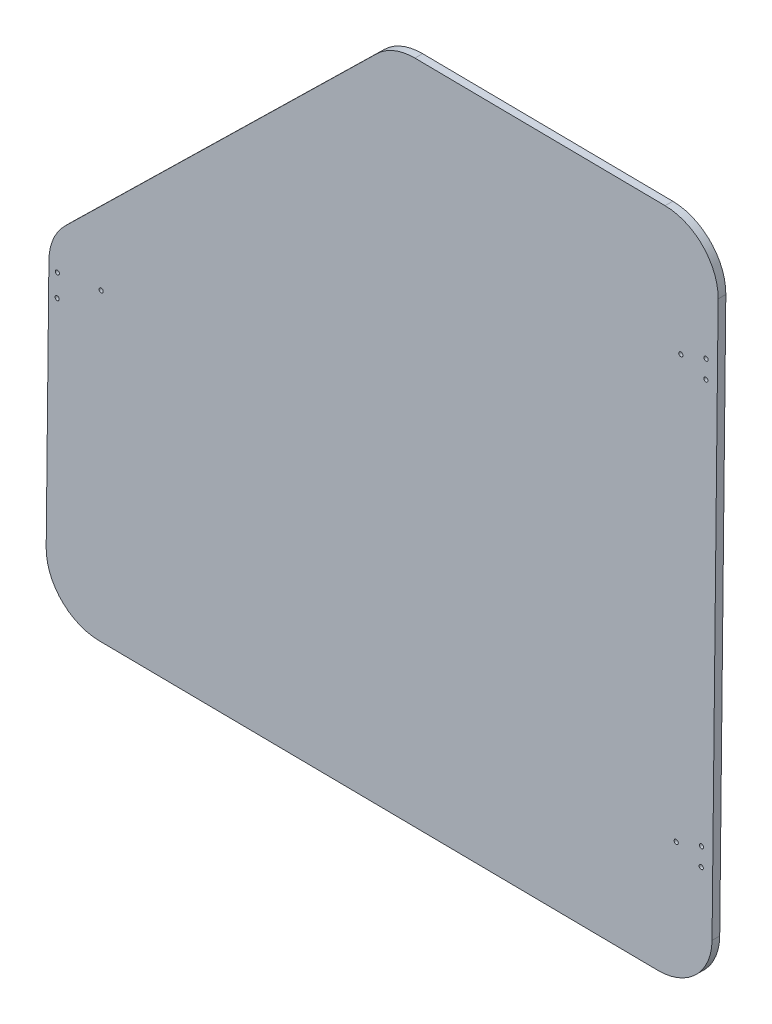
ISO-10303-21;
HEADER;
FILE_DESCRIPTION(('STEP AP214'),'2;1');
FILE_NAME('part.step','',(''),(''),'','','');
FILE_SCHEMA(('AUTOMOTIVE_DESIGN { 1 0 10303 214 1 1 1 1 }'));
ENDSEC;
DATA;
#1=APPLICATION_CONTEXT('core data for automotive mechanical design processes');
#2=APPLICATION_PROTOCOL_DEFINITION('international standard','automotive_design',2000,#1);
#3=PRODUCT_CONTEXT('',#1,'mechanical');
#4=PRODUCT('Part','Part','',(#3));
#5=PRODUCT_RELATED_PRODUCT_CATEGORY('part','',(#4));
#6=PRODUCT_DEFINITION_FORMATION('','',#4);
#7=PRODUCT_DEFINITION_CONTEXT('part definition',#1,'design');
#8=PRODUCT_DEFINITION('design','',#6,#7);
#9=PRODUCT_DEFINITION_SHAPE('','',#8);
#10=(LENGTH_UNIT() NAMED_UNIT(*) SI_UNIT(.MILLI.,.METRE.));
#11=(NAMED_UNIT(*) PLANE_ANGLE_UNIT() SI_UNIT($,.RADIAN.));
#12=(NAMED_UNIT(*) SI_UNIT($,.STERADIAN.) SOLID_ANGLE_UNIT());
#13=UNCERTAINTY_MEASURE_WITH_UNIT(LENGTH_MEASURE(1.E-05),#10,'distance_accuracy_value','');
#14=(GEOMETRIC_REPRESENTATION_CONTEXT(3) GLOBAL_UNCERTAINTY_ASSIGNED_CONTEXT((#13)) GLOBAL_UNIT_ASSIGNED_CONTEXT((#10,
#11,#12)) REPRESENTATION_CONTEXT('',''));
#15=CARTESIAN_POINT('',(0.,0.,0.));
#16=DIRECTION('',(0.,0.,1.));
#17=DIRECTION('',(1.,0.,0.));
#18=AXIS2_PLACEMENT_3D('',#15,#16,#17);
#19=CARTESIAN_POINT('',(6.10622663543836E-13,0.,-8.73125000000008));
#20=DIRECTION('',(0.,0.,-0.999999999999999));
#21=DIRECTION('',(-1.,0.,0.));
#22=AXIS2_PLACEMENT_3D('',#19,#20,#21);
#23=PLANE('',#22);
#24=CARTESIAN_POINT('',(-645.052766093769,303.914359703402,-8.7312500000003));
#25=DIRECTION('',(0.,0.,0.999999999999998));
#26=DIRECTION('',(1.,0.,0.));
#27=AXIS2_PLACEMENT_3D('',#24,#25,#26);
#28=CIRCLE('',#27,2.38124999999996);
#29=CARTESIAN_POINT('',(-642.671516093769,303.914359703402,-8.7312500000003));
#30=VERTEX_POINT('',#29);
#31=EDGE_CURVE('E245',#30,#30,#28,.T.);
#32=ORIENTED_EDGE('',*,*,#31,.T.);
#33=EDGE_LOOP('',(#32));
#34=FACE_BOUND('',#33,.T.);
#35=CARTESIAN_POINT('',(-694.84910221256,296.671532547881,-8.7312500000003));
#36=DIRECTION('',(0.,0.,0.999999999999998));
#37=DIRECTION('',(1.,0.,0.));
#38=AXIS2_PLACEMENT_3D('',#35,#36,#37);
#39=CIRCLE('',#38,2.38124999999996);
#40=CARTESIAN_POINT('',(-692.46785221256,296.671532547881,-8.7312500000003));
#41=VERTEX_POINT('',#40);
#42=EDGE_CURVE('E239',#41,#41,#39,.T.);
#43=ORIENTED_EDGE('',*,*,#42,.T.);
#44=EDGE_LOOP('',(#43));
#45=FACE_BOUND('',#44,.T.);
#46=CARTESIAN_POINT('',(-695.12693462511,271.273052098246,-8.7312500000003));
#47=DIRECTION('',(0.,0.,0.999999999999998));
#48=DIRECTION('',(1.,0.,0.));
#49=AXIS2_PLACEMENT_3D('',#46,#47,#48);
#50=CIRCLE('',#49,2.38124999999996);
#51=CARTESIAN_POINT('',(-692.74568462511,271.273052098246,-8.7312500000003));
#52=VERTEX_POINT('',#51);
#53=EDGE_CURVE('E233',#52,#52,#50,.T.);
#54=ORIENTED_EDGE('',*,*,#53,.T.);
#55=EDGE_LOOP('',(#54));
#56=FACE_BOUND('',#55,.T.);
#57=CARTESIAN_POINT('',(13.8398013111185,570.452754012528,-8.7312500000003));
#58=DIRECTION('',(0.,0.,0.999999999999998));
#59=DIRECTION('',(1.,0.,0.));
#60=AXIS2_PLACEMENT_3D('',#57,#58,#59);
#61=CIRCLE('',#60,2.38125000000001);
#62=CARTESIAN_POINT('',(16.2210513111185,570.452754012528,-8.7312500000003));
#63=VERTEX_POINT('',#62);
#64=EDGE_CURVE('E227',#63,#63,#61,.T.);
#65=ORIENTED_EDGE('',*,*,#64,.T.);
#66=EDGE_LOOP('',(#65));
#67=FACE_BOUND('',#66,.T.);
#68=CARTESIAN_POINT('',(42.5259612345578,580.458325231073,-8.73124999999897));
#69=DIRECTION('',(0.,0.,0.999999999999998));
#70=DIRECTION('',(1.,0.,0.));
#71=AXIS2_PLACEMENT_3D('',#68,#69,#70);
#72=CIRCLE('',#71,2.38125000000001);
#73=CARTESIAN_POINT('',(44.9072112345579,580.458325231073,-8.73124999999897));
#74=VERTEX_POINT('',#73);
#75=EDGE_CURVE('E221',#74,#74,#72,.T.);
#76=ORIENTED_EDGE('',*,*,#75,.T.);
#77=EDGE_LOOP('',(#76));
#78=FACE_BOUND('',#77,.T.);
#79=CARTESIAN_POINT('',(42.3002223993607,559.822059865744,-8.73124999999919));
#80=DIRECTION('',(0.,0.,0.999999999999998));
#81=DIRECTION('',(1.,0.,0.));
#82=AXIS2_PLACEMENT_3D('',#79,#80,#81);
#83=CIRCLE('',#82,2.38125000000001);
#84=CARTESIAN_POINT('',(44.6814723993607,559.822059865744,-8.73124999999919));
#85=VERTEX_POINT('',#84);
#86=EDGE_CURVE('E215',#85,#85,#83,.T.);
#87=ORIENTED_EDGE('',*,*,#86,.T.);
#88=EDGE_LOOP('',(#87));
#89=FACE_BOUND('',#88,.T.);
#90=CARTESIAN_POINT('',(37.2471453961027,97.8871966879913,-8.7312500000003));
#91=DIRECTION('',(0.,0.,0.999999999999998));
#92=DIRECTION('',(1.,0.,0.));
#93=AXIS2_PLACEMENT_3D('',#90,#91,#92);
#94=CIRCLE('',#93,2.38125);
#95=CARTESIAN_POINT('',(39.6283953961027,97.8871966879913,-8.7312500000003));
#96=VERTEX_POINT('',#95);
#97=EDGE_CURVE('E209',#96,#96,#94,.T.);
#98=ORIENTED_EDGE('',*,*,#97,.T.);
#99=EDGE_LOOP('',(#98));
#100=FACE_BOUND('',#99,.T.);
#101=CARTESIAN_POINT('',(8.56098547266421,87.8816254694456,-8.73124999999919));
#102=DIRECTION('',(0.,0.,0.999999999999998));
#103=DIRECTION('',(1.,0.,0.));
#104=AXIS2_PLACEMENT_3D('',#101,#102,#103);
#105=CIRCLE('',#104,2.38125);
#106=CARTESIAN_POINT('',(10.9422354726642,87.8816254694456,-8.73124999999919));
#107=VERTEX_POINT('',#106);
#108=EDGE_CURVE('E203',#107,#107,#105,.T.);
#109=ORIENTED_EDGE('',*,*,#108,.T.);
#110=EDGE_LOOP('',(#109));
#111=FACE_BOUND('',#110,.T.);
#112=CARTESIAN_POINT('',(37.0214065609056,77.2509313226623,-8.7312500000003));
#113=DIRECTION('',(0.,0.,0.999999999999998));
#114=DIRECTION('',(1.,0.,0.));
#115=AXIS2_PLACEMENT_3D('',#112,#113,#114);
#116=CIRCLE('',#115,2.38125);
#117=CARTESIAN_POINT('',(39.4026565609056,77.2509313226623,-8.7312500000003));
#118=VERTEX_POINT('',#117);
#119=EDGE_CURVE('E134',#118,#118,#116,.T.);
#120=ORIENTED_EDGE('',*,*,#119,.T.);
#121=EDGE_LOOP('',(#120));
#122=FACE_BOUND('',#121,.T.);
#123=CARTESIAN_POINT('',(-646.602573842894,18.8438603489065,-8.73125000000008));
#124=DIRECTION('',(0.,0.,-0.999999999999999));
#125=DIRECTION('',(0.,0.999999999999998,0.));
#126=AXIS2_PLACEMENT_3D('',#123,#124,#125);
#127=CIRCLE('',#126,60.9599999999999);
#128=CARTESIAN_POINT('',(-707.55892692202,19.5106581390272,-8.73124999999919));
#129=VERTEX_POINT('',#128);
#130=CARTESIAN_POINT('',(-647.269371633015,-42.1124927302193,-8.73125000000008));
#131=VERTEX_POINT('',#130);
#132=EDGE_CURVE('E43',#129,#131,#127,.F.);
#133=ORIENTED_EDGE('',*,*,#132,.F.);
#134=DIRECTION('',(-0.0109382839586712,-0.999940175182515,0.));
#135=VECTOR('',#134,1.);
#136=CARTESIAN_POINT('',(-704.447852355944,303.914359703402,-8.7312500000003));
#137=LINE('',#136,#135);
#138=CARTESIAN_POINT('',(-704.447852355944,303.914359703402,-8.73125000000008));
#139=VERTEX_POINT('',#138);
#140=EDGE_CURVE('E142',#139,#129,#137,.T.);
#141=ORIENTED_EDGE('',*,*,#140,.F.);
#142=CARTESIAN_POINT('',(-643.491499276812,303.247561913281,-8.7312500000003));
#143=DIRECTION('',(0.,0.,-0.999999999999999));
#144=DIRECTION('',(0.,0.999999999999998,0.));
#145=AXIS2_PLACEMENT_3D('',#142,#143,#144);
#146=CIRCLE('',#145,60.9600000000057);
#147=CARTESIAN_POINT('',(-686.122652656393,346.821709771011,-8.7312500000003));
#148=VERTEX_POINT('',#147);
#149=EDGE_CURVE('E146',#148,#139,#146,.F.);
#150=ORIENTED_EDGE('',*,*,#149,.F.);
#151=DIRECTION('',(-0.714799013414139,-0.699329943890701,0.));
#152=VECTOR('',#151,1.);
#153=CARTESIAN_POINT('',(-331.729607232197,693.545283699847,-8.73124999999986));
#154=LINE('',#153,#152);
#155=CARTESIAN_POINT('',(-331.729607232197,693.545283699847,-8.73124999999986));
#156=VERTEX_POINT('',#155);
#157=EDGE_CURVE('E150',#156,#148,#154,.T.);
#158=ORIENTED_EDGE('',*,*,#157,.F.);
#159=CARTESIAN_POINT('',(-289.098453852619,649.971135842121,-8.73125000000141));
#160=DIRECTION('',(0.,0.,-0.999999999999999));
#161=DIRECTION('',(0.,0.999999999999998,0.));
#162=AXIS2_PLACEMENT_3D('',#159,#160,#161);
#163=CIRCLE('',#162,60.9600000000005);
#164=CARTESIAN_POINT('',(-288.431656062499,710.927488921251,-8.7312500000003));
#165=VERTEX_POINT('',#164);
#166=EDGE_CURVE('E154',#165,#156,#163,.F.);
#167=ORIENTED_EDGE('',*,*,#166,.F.);
#168=DIRECTION('',(-0.999940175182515,0.0109382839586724,0.));
#169=VECTOR('',#168,1.);
#170=CARTESIAN_POINT('',(-4.02795449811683,707.816414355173,-8.7312500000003));
#171=LINE('',#170,#169);
#172=CARTESIAN_POINT('',(-4.02795449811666,707.816414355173,-8.7312500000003));
#173=VERTEX_POINT('',#172);
#174=EDGE_CURVE('E158',#173,#165,#171,.T.);
#175=ORIENTED_EDGE('',*,*,#174,.F.);
#176=CARTESIAN_POINT('',(-4.69475228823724,646.860061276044,-8.7312500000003));
#177=DIRECTION('',(0.,0.,-0.999999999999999));
#178=DIRECTION('',(0.,0.999999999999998,0.));
#179=AXIS2_PLACEMENT_3D('',#176,#177,#178);
#180=CIRCLE('',#179,60.9600000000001);
#181=CARTESIAN_POINT('',(56.2616007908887,646.193263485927,-8.73125000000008));
#182=VERTEX_POINT('',#181);
#183=EDGE_CURVE('E162',#182,#173,#180,.F.);
#184=ORIENTED_EDGE('',*,*,#183,.F.);
#185=DIRECTION('',(0.0109382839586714,0.999940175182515,0.));
#186=VECTOR('',#185,1.);
#187=CARTESIAN_POINT('',(49.3157904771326,11.23125224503,-8.73125000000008));
#188=LINE('',#187,#186);
#189=CARTESIAN_POINT('',(49.3157904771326,11.2312522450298,-8.73125000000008));
#190=VERTEX_POINT('',#189);
#191=EDGE_CURVE('E84',#190,#182,#188,.T.);
#192=ORIENTED_EDGE('',*,*,#191,.F.);
#193=CARTESIAN_POINT('',(-11.6405626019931,11.8980500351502,-8.73125000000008));
#194=DIRECTION('',(0.,0.,-0.999999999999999));
#195=DIRECTION('',(0.,0.999999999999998,0.));
#196=AXIS2_PLACEMENT_3D('',#193,#194,#195);
#197=CIRCLE('',#196,60.9599999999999);
#198=CARTESIAN_POINT('',(-12.3073603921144,-49.0583030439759,-8.73125000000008));
#199=VERTEX_POINT('',#198);
#200=EDGE_CURVE('E89',#199,#190,#197,.F.);
#201=ORIENTED_EDGE('',*,*,#200,.F.);
#202=DIRECTION('',(0.999940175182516,-0.0109382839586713,0.));
#203=VECTOR('',#202,1.);
#204=CARTESIAN_POINT('',(-647.269371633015,-42.1124927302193,-8.73125000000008));
#205=LINE('',#204,#203);
#206=EDGE_CURVE('E122',#131,#199,#205,.T.);
#207=ORIENTED_EDGE('',*,*,#206,.F.);
#208=EDGE_LOOP('',(#133,#141,#150,#158,#167,#175,#184,#192,#201,#207));
#209=FACE_BOUND('',#208,.T.);
#210=ADVANCED_FACE('F35',(#34,#45,#56,#67,#78,#89,#100,#111,#122,#209),#23,.T.);
#211=CARTESIAN_POINT('',(-646.602573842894,18.8438603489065,0.));
#212=DIRECTION('',(0.,0.,0.999999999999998));
#213=DIRECTION('',(1.,0.,0.));
#214=AXIS2_PLACEMENT_3D('',#211,#212,#213);
#215=PLANE('',#214);
#216=CARTESIAN_POINT('',(-645.052766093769,303.914359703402,-4.44089209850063E-13));
#217=DIRECTION('',(0.,0.,0.999999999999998));
#218=DIRECTION('',(1.,0.,0.));
#219=AXIS2_PLACEMENT_3D('',#216,#217,#218);
#220=CIRCLE('',#219,2.38124999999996);
#221=CARTESIAN_POINT('',(-642.671516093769,303.914359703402,-4.45823933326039E-13));
#222=VERTEX_POINT('',#221);
#223=EDGE_CURVE('E248',#222,#222,#220,.T.);
#224=ORIENTED_EDGE('',*,*,#223,.F.);
#225=EDGE_LOOP('',(#224));
#226=FACE_BOUND('',#225,.T.);
#227=CARTESIAN_POINT('',(-694.84910221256,296.671532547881,0.));
#228=DIRECTION('',(0.,0.,0.999999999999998));
#229=DIRECTION('',(1.,0.,0.));
#230=AXIS2_PLACEMENT_3D('',#227,#228,#229);
#231=CIRCLE('',#230,2.38124999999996);
#232=CARTESIAN_POINT('',(-692.46785221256,296.671532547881,0.));
#233=VERTEX_POINT('',#232);
#234=EDGE_CURVE('E242',#233,#233,#231,.T.);
#235=ORIENTED_EDGE('',*,*,#234,.F.);
#236=EDGE_LOOP('',(#235));
#237=FACE_BOUND('',#236,.T.);
#238=CARTESIAN_POINT('',(-695.12693462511,271.273052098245,0.));
#239=DIRECTION('',(0.,0.,0.999999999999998));
#240=DIRECTION('',(1.,0.,0.));
#241=AXIS2_PLACEMENT_3D('',#238,#239,#240);
#242=CIRCLE('',#241,2.38124999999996);
#243=CARTESIAN_POINT('',(-692.74568462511,271.273052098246,0.));
#244=VERTEX_POINT('',#243);
#245=EDGE_CURVE('E236',#244,#244,#242,.T.);
#246=ORIENTED_EDGE('',*,*,#245,.F.);
#247=EDGE_LOOP('',(#246));
#248=FACE_BOUND('',#247,.T.);
#249=CARTESIAN_POINT('',(13.8398013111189,570.452754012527,0.));
#250=DIRECTION('',(0.,0.,0.999999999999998));
#251=DIRECTION('',(1.,0.,0.));
#252=AXIS2_PLACEMENT_3D('',#249,#250,#251);
#253=CIRCLE('',#252,2.38125000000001);
#254=CARTESIAN_POINT('',(16.2210513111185,570.452754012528,0.));
#255=VERTEX_POINT('',#254);
#256=EDGE_CURVE('E230',#255,#255,#253,.T.);
#257=ORIENTED_EDGE('',*,*,#256,.F.);
#258=EDGE_LOOP('',(#257));
#259=FACE_BOUND('',#258,.T.);
#260=CARTESIAN_POINT('',(42.5259612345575,580.458325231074,0.));
#261=DIRECTION('',(0.,0.,0.999999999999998));
#262=DIRECTION('',(1.,0.,0.));
#263=AXIS2_PLACEMENT_3D('',#260,#261,#262);
#264=CIRCLE('',#263,2.38125000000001);
#265=CARTESIAN_POINT('',(44.9072112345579,580.458325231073,0.));
#266=VERTEX_POINT('',#265);
#267=EDGE_CURVE('E224',#266,#266,#264,.T.);
#268=ORIENTED_EDGE('',*,*,#267,.F.);
#269=EDGE_LOOP('',(#268));
#270=FACE_BOUND('',#269,.T.);
#271=CARTESIAN_POINT('',(42.3002223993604,559.822059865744,0.));
#272=DIRECTION('',(0.,0.,0.999999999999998));
#273=DIRECTION('',(1.,0.,0.));
#274=AXIS2_PLACEMENT_3D('',#271,#272,#273);
#275=CIRCLE('',#274,2.38125000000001);
#276=CARTESIAN_POINT('',(44.6814723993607,559.822059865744,0.));
#277=VERTEX_POINT('',#276);
#278=EDGE_CURVE('E218',#277,#277,#275,.T.);
#279=ORIENTED_EDGE('',*,*,#278,.F.);
#280=EDGE_LOOP('',(#279));
#281=FACE_BOUND('',#280,.T.);
#282=CARTESIAN_POINT('',(37.2471453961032,97.8871966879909,3.33066907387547E-12));
#283=DIRECTION('',(0.,0.,0.999999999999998));
#284=DIRECTION('',(1.,0.,0.));
#285=AXIS2_PLACEMENT_3D('',#282,#283,#284);
#286=CIRCLE('',#285,2.38125);
#287=CARTESIAN_POINT('',(39.6283953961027,97.8871966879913,3.32893435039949E-12));
#288=VERTEX_POINT('',#287);
#289=EDGE_CURVE('E212',#288,#288,#286,.T.);
#290=ORIENTED_EDGE('',*,*,#289,.F.);
#291=EDGE_LOOP('',(#290));
#292=FACE_BOUND('',#291,.T.);
#293=CARTESIAN_POINT('',(8.56098547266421,87.8816254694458,0.));
#294=DIRECTION('',(0.,0.,0.999999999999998));
#295=DIRECTION('',(1.,0.,0.));
#296=AXIS2_PLACEMENT_3D('',#293,#294,#295);
#297=CIRCLE('',#296,2.38125);
#298=CARTESIAN_POINT('',(10.9422354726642,87.8816254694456,0.));
#299=VERTEX_POINT('',#298);
#300=EDGE_CURVE('E206',#299,#299,#297,.T.);
#301=ORIENTED_EDGE('',*,*,#300,.F.);
#302=EDGE_LOOP('',(#301));
#303=FACE_BOUND('',#302,.T.);
#304=CARTESIAN_POINT('',(37.0214065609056,77.2509313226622,0.));
#305=DIRECTION('',(0.,0.,0.999999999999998));
#306=DIRECTION('',(1.,0.,0.));
#307=AXIS2_PLACEMENT_3D('',#304,#305,#306);
#308=CIRCLE('',#307,2.38125);
#309=CARTESIAN_POINT('',(39.4026565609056,77.2509313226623,0.));
#310=VERTEX_POINT('',#309);
#311=EDGE_CURVE('E200',#310,#310,#308,.T.);
#312=ORIENTED_EDGE('',*,*,#311,.F.);
#313=EDGE_LOOP('',(#312));
#314=FACE_BOUND('',#313,.T.);
#315=CARTESIAN_POINT('',(-646.602573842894,18.8438603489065,0.));
#316=DIRECTION('',(0.,0.,0.999999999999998));
#317=DIRECTION('',(1.,0.,0.));
#318=AXIS2_PLACEMENT_3D('',#315,#316,#317);
#319=CIRCLE('',#318,60.9599999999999);
#320=CARTESIAN_POINT('',(-707.55892692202,19.5106581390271,1.33226762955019E-12));
#321=VERTEX_POINT('',#320);
#322=CARTESIAN_POINT('',(-647.269371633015,-42.1124927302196,0.));
#323=VERTEX_POINT('',#322);
#324=EDGE_CURVE('E132',#321,#323,#319,.T.);
#325=ORIENTED_EDGE('',*,*,#324,.T.);
#326=DIRECTION('',(0.999940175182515,-0.0109382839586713,0.));
#327=VECTOR('',#326,1.);
#328=CARTESIAN_POINT('',(-647.269371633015,-42.1124927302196,0.));
#329=LINE('',#328,#327);
#330=CARTESIAN_POINT('',(-12.3073603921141,-49.0583030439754,0.));
#331=VERTEX_POINT('',#330);
#332=EDGE_CURVE('E120',#323,#331,#329,.T.);
#333=ORIENTED_EDGE('',*,*,#332,.T.);
#334=CARTESIAN_POINT('',(-11.6405626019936,11.8980500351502,0.));
#335=DIRECTION('',(0.,0.,0.999999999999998));
#336=DIRECTION('',(1.,0.,0.));
#337=AXIS2_PLACEMENT_3D('',#334,#335,#336);
#338=CIRCLE('',#337,60.9599999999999);
#339=CARTESIAN_POINT('',(49.3157904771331,11.2312522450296,3.33066907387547E-12));
#340=VERTEX_POINT('',#339);
#341=EDGE_CURVE('E124',#331,#340,#338,.T.);
#342=ORIENTED_EDGE('',*,*,#341,.T.);
#343=DIRECTION('',(0.0109382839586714,0.999940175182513,0.));
#344=VECTOR('',#343,1.);
#345=CARTESIAN_POINT('',(49.3157904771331,11.2312522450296,3.33066907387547E-12));
#346=LINE('',#345,#344);
#347=CARTESIAN_POINT('',(56.2616007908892,646.193263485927,0.));
#348=VERTEX_POINT('',#347);
#349=EDGE_CURVE('E128',#340,#348,#346,.T.);
#350=ORIENTED_EDGE('',*,*,#349,.T.);
#351=CARTESIAN_POINT('',(-4.69475228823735,646.860061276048,0.));
#352=DIRECTION('',(0.,0.,0.999999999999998));
#353=DIRECTION('',(1.,0.,0.));
#354=AXIS2_PLACEMENT_3D('',#351,#352,#353);
#355=CIRCLE('',#354,60.9600000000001);
#356=CARTESIAN_POINT('',(-4.0279544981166,707.816414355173,4.44089209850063E-13));
#357=VERTEX_POINT('',#356);
#358=EDGE_CURVE('E181',#348,#357,#355,.T.);
#359=ORIENTED_EDGE('',*,*,#358,.T.);
#360=DIRECTION('',(-0.999940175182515,0.0109382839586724,0.));
#361=VECTOR('',#360,1.);
#362=CARTESIAN_POINT('',(-4.0279544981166,707.816414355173,4.44089209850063E-13));
#363=LINE('',#362,#361);
#364=CARTESIAN_POINT('',(-288.431656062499,710.927488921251,2.22044604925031E-13));
#365=VERTEX_POINT('',#364);
#366=EDGE_CURVE('E186',#357,#365,#363,.T.);
#367=ORIENTED_EDGE('',*,*,#366,.T.);
#368=CARTESIAN_POINT('',(-289.098453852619,649.971135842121,-6.66133814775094E-13));
#369=DIRECTION('',(0.,0.,0.999999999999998));
#370=DIRECTION('',(1.,0.,0.));
#371=AXIS2_PLACEMENT_3D('',#368,#369,#370);
#372=CIRCLE('',#371,60.9600000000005);
#373=CARTESIAN_POINT('',(-331.729607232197,693.545283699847,0.));
#374=VERTEX_POINT('',#373);
#375=EDGE_CURVE('E190',#365,#374,#372,.T.);
#376=ORIENTED_EDGE('',*,*,#375,.T.);
#377=DIRECTION('',(-0.714799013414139,-0.699329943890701,0.));
#378=VECTOR('',#377,1.);
#379=CARTESIAN_POINT('',(-331.729607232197,693.545283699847,0.));
#380=LINE('',#379,#378);
#381=CARTESIAN_POINT('',(-686.122652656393,346.821709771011,0.));
#382=VERTEX_POINT('',#381);
#383=EDGE_CURVE('E193',#374,#382,#380,.T.);
#384=ORIENTED_EDGE('',*,*,#383,.T.);
#385=CARTESIAN_POINT('',(-643.491499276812,303.24756191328,0.));
#386=DIRECTION('',(0.,0.,0.999999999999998));
#387=DIRECTION('',(1.,0.,0.));
#388=AXIS2_PLACEMENT_3D('',#385,#386,#387);
#389=CIRCLE('',#388,60.9600000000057);
#390=CARTESIAN_POINT('',(-704.447852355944,303.914359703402,0.));
#391=VERTEX_POINT('',#390);
#392=EDGE_CURVE('E196',#382,#391,#389,.T.);
#393=ORIENTED_EDGE('',*,*,#392,.T.);
#394=DIRECTION('',(-0.0109382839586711,-0.999940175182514,0.));
#395=VECTOR('',#394,1.);
#396=CARTESIAN_POINT('',(-704.447852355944,303.914359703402,0.));
#397=LINE('',#396,#395);
#398=EDGE_CURVE('E139',#391,#321,#397,.T.);
#399=ORIENTED_EDGE('',*,*,#398,.T.);
#400=EDGE_LOOP('',(#325,#333,#342,#350,#359,#367,#376,#384,#393,#399));
#401=FACE_BOUND('',#400,.T.);
#402=ADVANCED_FACE('F130',(#226,#237,#248,#259,#270,#281,#292,#303,#314,#401),#215,.T.);
#403=CARTESIAN_POINT('',(-647.269371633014,-42.1124927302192,-1086.23875876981));
#404=DIRECTION('',(-0.0109382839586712,-0.999940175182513,0.));
#405=DIRECTION('',(0.999940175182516,-0.0109382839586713,0.));
#406=AXIS2_PLACEMENT_3D('',#403,#404,#405);
#407=PLANE('',#406);
#408=DIRECTION('',(0.,0.,0.999999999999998));
#409=VECTOR('',#408,1.);
#410=CARTESIAN_POINT('',(-647.269371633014,-42.1124927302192,-1086.23875876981));
#411=LINE('',#410,#409);
#412=EDGE_CURVE('E11',#131,#323,#411,.T.);
#413=ORIENTED_EDGE('',*,*,#412,.F.);
#414=ORIENTED_EDGE('',*,*,#206,.T.);
#415=DIRECTION('',(0.,0.,0.999999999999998));
#416=VECTOR('',#415,1.);
#417=CARTESIAN_POINT('',(-12.307360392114,-49.058303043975,-1086.23875876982));
#418=LINE('',#417,#416);
#419=EDGE_CURVE('E117',#199,#331,#418,.T.);
#420=ORIENTED_EDGE('',*,*,#419,.T.);
#421=ORIENTED_EDGE('',*,*,#332,.F.);
#422=EDGE_LOOP('',(#413,#414,#420,#421));
#423=FACE_BOUND('',#422,.T.);
#424=ADVANCED_FACE('F118',(#423),#407,.T.);
#425=CARTESIAN_POINT('',(-11.6405626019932,11.8980500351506,-1086.23875876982));
#426=DIRECTION('',(0.,0.,0.999999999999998));
#427=DIRECTION('',(1.,0.,0.));
#428=AXIS2_PLACEMENT_3D('',#425,#426,#427);
#429=CYLINDRICAL_SURFACE('',#428,60.9599999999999);
#430=ORIENTED_EDGE('',*,*,#419,.F.);
#431=ORIENTED_EDGE('',*,*,#200,.T.);
#432=DIRECTION('',(0.,0.,0.999999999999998));
#433=VECTOR('',#432,1.);
#434=CARTESIAN_POINT('',(49.315790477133,11.2312522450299,-1086.23875876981));
#435=LINE('',#434,#433);
#436=EDGE_CURVE('E112',#190,#340,#435,.T.);
#437=ORIENTED_EDGE('',*,*,#436,.T.);
#438=ORIENTED_EDGE('',*,*,#341,.F.);
#439=EDGE_LOOP('',(#430,#431,#437,#438));
#440=FACE_BOUND('',#439,.T.);
#441=ADVANCED_FACE('F125',(#440),#429,.T.);
#442=CARTESIAN_POINT('',(49.315790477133,11.2312522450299,-1086.23875876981));
#443=DIRECTION('',(0.999940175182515,-0.0109382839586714,0.));
#444=DIRECTION('',(0.0109382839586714,0.999940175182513,0.));
#445=AXIS2_PLACEMENT_3D('',#442,#443,#444);
#446=PLANE('',#445);
#447=ORIENTED_EDGE('',*,*,#436,.F.);
#448=ORIENTED_EDGE('',*,*,#191,.T.);
#449=DIRECTION('',(0.,0.,0.999999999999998));
#450=VECTOR('',#449,1.);
#451=CARTESIAN_POINT('',(56.2616007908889,646.193263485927,-1086.23875876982));
#452=LINE('',#451,#450);
#453=EDGE_CURVE('E165',#182,#348,#452,.T.);
#454=ORIENTED_EDGE('',*,*,#453,.T.);
#455=ORIENTED_EDGE('',*,*,#349,.F.);
#456=EDGE_LOOP('',(#447,#448,#454,#455));
#457=FACE_BOUND('',#456,.T.);
#458=ADVANCED_FACE('F178',(#457),#446,.T.);
#459=CARTESIAN_POINT('',(-4.69475228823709,646.860061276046,-1086.23875876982));
#460=DIRECTION('',(0.,0.,0.999999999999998));
#461=DIRECTION('',(1.,0.,0.));
#462=AXIS2_PLACEMENT_3D('',#459,#460,#461);
#463=CYLINDRICAL_SURFACE('',#462,60.9600000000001);
#464=ORIENTED_EDGE('',*,*,#453,.F.);
#465=ORIENTED_EDGE('',*,*,#183,.T.);
#466=DIRECTION('',(0.,0.,0.999999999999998));
#467=VECTOR('',#466,1.);
#468=CARTESIAN_POINT('',(-4.02795449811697,707.816414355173,-1086.23875876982));
#469=LINE('',#468,#467);
#470=EDGE_CURVE('E161',#173,#357,#469,.T.);
#471=ORIENTED_EDGE('',*,*,#470,.T.);
#472=ORIENTED_EDGE('',*,*,#358,.F.);
#473=EDGE_LOOP('',(#464,#465,#471,#472));
#474=FACE_BOUND('',#473,.T.);
#475=ADVANCED_FACE('F182',(#474),#463,.T.);
#476=CARTESIAN_POINT('',(-4.02795449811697,707.816414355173,-1086.23875876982));
#477=DIRECTION('',(0.0109382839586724,0.999940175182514,0.));
#478=DIRECTION('',(-0.999940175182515,0.0109382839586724,0.));
#479=AXIS2_PLACEMENT_3D('',#476,#477,#478);
#480=PLANE('',#479);
#481=ORIENTED_EDGE('',*,*,#470,.F.);
#482=ORIENTED_EDGE('',*,*,#174,.T.);
#483=DIRECTION('',(0.,0.,0.999999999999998));
#484=VECTOR('',#483,1.);
#485=CARTESIAN_POINT('',(-288.431656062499,710.927488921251,-1086.23875876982));
#486=LINE('',#485,#484);
#487=EDGE_CURVE('E157',#165,#365,#486,.T.);
#488=ORIENTED_EDGE('',*,*,#487,.T.);
#489=ORIENTED_EDGE('',*,*,#366,.F.);
#490=EDGE_LOOP('',(#481,#482,#488,#489));
#491=FACE_BOUND('',#490,.T.);
#492=ADVANCED_FACE('F328',(#491),#480,.T.);
#493=CARTESIAN_POINT('',(-289.098453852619,649.971135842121,-1086.23875876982));
#494=DIRECTION('',(0.,0.,0.999999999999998));
#495=DIRECTION('',(1.,0.,0.));
#496=AXIS2_PLACEMENT_3D('',#493,#494,#495);
#497=CYLINDRICAL_SURFACE('',#496,60.9600000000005);
#498=ORIENTED_EDGE('',*,*,#487,.F.);
#499=ORIENTED_EDGE('',*,*,#166,.T.);
#500=DIRECTION('',(0.,0.,0.999999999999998));
#501=VECTOR('',#500,1.);
#502=CARTESIAN_POINT('',(-331.729607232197,693.545283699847,-1086.23875876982));
#503=LINE('',#502,#501);
#504=EDGE_CURVE('E153',#156,#374,#503,.T.);
#505=ORIENTED_EDGE('',*,*,#504,.T.);
#506=ORIENTED_EDGE('',*,*,#375,.F.);
#507=EDGE_LOOP('',(#498,#499,#505,#506));
#508=FACE_BOUND('',#507,.T.);
#509=ADVANCED_FACE('F335',(#508),#497,.T.);
#510=CARTESIAN_POINT('',(-331.729607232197,693.545283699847,-1086.23875876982));
#511=DIRECTION('',(-0.699329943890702,0.714799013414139,0.));
#512=DIRECTION('',(-0.714799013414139,-0.699329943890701,0.));
#513=AXIS2_PLACEMENT_3D('',#510,#511,#512);
#514=PLANE('',#513);
#515=ORIENTED_EDGE('',*,*,#504,.F.);
#516=ORIENTED_EDGE('',*,*,#157,.T.);
#517=DIRECTION('',(0.,0.,0.999999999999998));
#518=VECTOR('',#517,1.);
#519=CARTESIAN_POINT('',(-686.122652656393,346.821709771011,-1086.23875876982));
#520=LINE('',#519,#518);
#521=EDGE_CURVE('E149',#148,#382,#520,.T.);
#522=ORIENTED_EDGE('',*,*,#521,.T.);
#523=ORIENTED_EDGE('',*,*,#383,.F.);
#524=EDGE_LOOP('',(#515,#516,#522,#523));
#525=FACE_BOUND('',#524,.T.);
#526=ADVANCED_FACE('F343',(#525),#514,.T.);
#527=CARTESIAN_POINT('',(-643.491499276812,303.247561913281,-1086.23875876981));
#528=DIRECTION('',(0.,0.,0.999999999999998));
#529=DIRECTION('',(1.,0.,0.));
#530=AXIS2_PLACEMENT_3D('',#527,#528,#529);
#531=CYLINDRICAL_SURFACE('',#530,60.9600000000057);
#532=ORIENTED_EDGE('',*,*,#521,.F.);
#533=ORIENTED_EDGE('',*,*,#149,.T.);
#534=DIRECTION('',(0.,0.,0.999999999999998));
#535=VECTOR('',#534,1.);
#536=CARTESIAN_POINT('',(-704.447852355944,303.914359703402,-1086.23875876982));
#537=LINE('',#536,#535);
#538=EDGE_CURVE('E145',#139,#391,#537,.T.);
#539=ORIENTED_EDGE('',*,*,#538,.T.);
#540=ORIENTED_EDGE('',*,*,#392,.F.);
#541=EDGE_LOOP('',(#532,#533,#539,#540));
#542=FACE_BOUND('',#541,.T.);
#543=ADVANCED_FACE('F351',(#542),#531,.T.);
#544=CARTESIAN_POINT('',(-704.447852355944,303.914359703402,-1086.23875876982));
#545=DIRECTION('',(-0.999940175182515,0.0109382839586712,0.));
#546=DIRECTION('',(-0.0109382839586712,-0.999940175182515,0.));
#547=AXIS2_PLACEMENT_3D('',#544,#545,#546);
#548=PLANE('',#547);
#549=ORIENTED_EDGE('',*,*,#538,.F.);
#550=ORIENTED_EDGE('',*,*,#140,.T.);
#551=DIRECTION('',(0.,0.,0.999999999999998));
#552=VECTOR('',#551,1.);
#553=CARTESIAN_POINT('',(-707.55892692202,19.5106581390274,-1086.23875876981));
#554=LINE('',#553,#552);
#555=EDGE_CURVE('E141',#129,#321,#554,.T.);
#556=ORIENTED_EDGE('',*,*,#555,.T.);
#557=ORIENTED_EDGE('',*,*,#398,.F.);
#558=EDGE_LOOP('',(#549,#550,#556,#557));
#559=FACE_BOUND('',#558,.T.);
#560=ADVANCED_FACE('F295',(#559),#548,.T.);
#561=CARTESIAN_POINT('',(-646.602573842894,18.843860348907,-1086.23875876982));
#562=DIRECTION('',(0.,0.,0.999999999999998));
#563=DIRECTION('',(1.,0.,0.));
#564=AXIS2_PLACEMENT_3D('',#561,#562,#563);
#565=CYLINDRICAL_SURFACE('',#564,60.9599999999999);
#566=ORIENTED_EDGE('',*,*,#555,.F.);
#567=ORIENTED_EDGE('',*,*,#132,.T.);
#568=ORIENTED_EDGE('',*,*,#412,.T.);
#569=ORIENTED_EDGE('',*,*,#324,.F.);
#570=EDGE_LOOP('',(#566,#567,#568,#569));
#571=FACE_BOUND('',#570,.T.);
#572=ADVANCED_FACE('F285',(#571),#565,.T.);
#573=CARTESIAN_POINT('',(37.0214065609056,77.2509313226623,-8.7312500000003));
#574=DIRECTION('',(0.,0.,0.999999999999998));
#575=DIRECTION('',(1.,0.,0.));
#576=AXIS2_PLACEMENT_3D('',#573,#574,#575);
#577=CYLINDRICAL_SURFACE('',#576,2.38125);
#578=CARTESIAN_POINT('',(39.4026565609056,77.2509313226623,-8.7312500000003));
#579=CARTESIAN_POINT('',(39.4026565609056,77.2509313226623,-8.64029947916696));
#580=CARTESIAN_POINT('',(39.4026565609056,77.2509313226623,-8.54934895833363));
#581=CARTESIAN_POINT('',(39.4026565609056,77.2509313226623,-8.36744791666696));
#582=CARTESIAN_POINT('',(39.4026565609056,77.2509313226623,-8.27649739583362));
#583=CARTESIAN_POINT('',(39.4026565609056,77.2509313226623,-8.09459635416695));
#584=CARTESIAN_POINT('',(39.4026565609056,77.2509313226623,-8.00364583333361));
#585=CARTESIAN_POINT('',(39.4026565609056,77.2509313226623,-7.82174479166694));
#586=CARTESIAN_POINT('',(39.4026565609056,77.2509313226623,-7.7307942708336));
#587=CARTESIAN_POINT('',(39.4026565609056,77.2509313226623,-7.54889322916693));
#588=CARTESIAN_POINT('',(39.4026565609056,77.2509313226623,-7.45794270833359));
#589=CARTESIAN_POINT('',(39.4026565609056,77.2509313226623,-7.27604166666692));
#590=CARTESIAN_POINT('',(39.4026565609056,77.2509313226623,-7.18509114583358));
#591=CARTESIAN_POINT('',(39.4026565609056,77.2509313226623,-7.00319010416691));
#592=CARTESIAN_POINT('',(39.4026565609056,77.2509313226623,-6.91223958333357));
#593=CARTESIAN_POINT('',(39.4026565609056,77.2509313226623,-6.7303385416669));
#594=CARTESIAN_POINT('',(39.4026565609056,77.2509313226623,-6.63938802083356));
#595=CARTESIAN_POINT('',(39.4026565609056,77.2509313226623,-6.45748697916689));
#596=CARTESIAN_POINT('',(39.4026565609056,77.2509313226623,-6.36653645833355));
#597=CARTESIAN_POINT('',(39.4026565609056,77.2509313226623,-6.18463541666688));
#598=CARTESIAN_POINT('',(39.4026565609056,77.2509313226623,-6.09368489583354));
#599=CARTESIAN_POINT('',(39.4026565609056,77.2509313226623,-5.91178385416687));
#600=CARTESIAN_POINT('',(39.4026565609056,77.2509313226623,-5.82083333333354));
#601=CARTESIAN_POINT('',(39.4026565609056,77.2509313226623,-5.63893229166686));
#602=CARTESIAN_POINT('',(39.4026565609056,77.2509313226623,-5.54798177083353));
#603=CARTESIAN_POINT('',(39.4026565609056,77.2509313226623,-5.36608072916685));
#604=CARTESIAN_POINT('',(39.4026565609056,77.2509313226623,-5.27513020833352));
#605=CARTESIAN_POINT('',(39.4026565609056,77.2509313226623,-5.09322916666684));
#606=CARTESIAN_POINT('',(39.4026565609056,77.2509313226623,-5.00227864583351));
#607=CARTESIAN_POINT('',(39.4026565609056,77.2509313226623,-4.82037760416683));
#608=CARTESIAN_POINT('',(39.4026565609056,77.2509313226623,-4.7294270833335));
#609=CARTESIAN_POINT('',(39.4026565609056,77.2509313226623,-4.54752604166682));
#610=CARTESIAN_POINT('',(39.4026565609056,77.2509313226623,-4.45657552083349));
#611=CARTESIAN_POINT('',(39.4026565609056,77.2509313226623,-4.27467447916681));
#612=CARTESIAN_POINT('',(39.4026565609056,77.2509313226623,-4.18372395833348));
#613=CARTESIAN_POINT('',(39.4026565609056,77.2509313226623,-4.00182291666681));
#614=CARTESIAN_POINT('',(39.4026565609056,77.2509313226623,-3.91087239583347));
#615=CARTESIAN_POINT('',(39.4026565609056,77.2509313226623,-3.7289713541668));
#616=CARTESIAN_POINT('',(39.4026565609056,77.2509313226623,-3.63802083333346));
#617=CARTESIAN_POINT('',(39.4026565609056,77.2509313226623,-3.45611979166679));
#618=CARTESIAN_POINT('',(39.4026565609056,77.2509313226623,-3.36516927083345));
#619=CARTESIAN_POINT('',(39.4026565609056,77.2509313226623,-3.18326822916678));
#620=CARTESIAN_POINT('',(39.4026565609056,77.2509313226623,-3.09231770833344));
#621=CARTESIAN_POINT('',(39.4026565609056,77.2509313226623,-2.91041666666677));
#622=CARTESIAN_POINT('',(39.4026565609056,77.2509313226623,-2.81946614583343));
#623=CARTESIAN_POINT('',(39.4026565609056,77.2509313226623,-2.63756510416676));
#624=CARTESIAN_POINT('',(39.4026565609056,77.2509313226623,-2.54661458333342));
#625=CARTESIAN_POINT('',(39.4026565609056,77.2509313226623,-2.36471354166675));
#626=CARTESIAN_POINT('',(39.4026565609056,77.2509313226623,-2.27376302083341));
#627=CARTESIAN_POINT('',(39.4026565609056,77.2509313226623,-2.09186197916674));
#628=CARTESIAN_POINT('',(39.4026565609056,77.2509313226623,-2.0009114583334));
#629=CARTESIAN_POINT('',(39.4026565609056,77.2509313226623,-1.81901041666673));
#630=CARTESIAN_POINT('',(39.4026565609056,77.2509313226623,-1.72805989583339));
#631=CARTESIAN_POINT('',(39.4026565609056,77.2509313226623,-1.54615885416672));
#632=CARTESIAN_POINT('',(39.4026565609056,77.2509313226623,-1.45520833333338));
#633=CARTESIAN_POINT('',(39.4026565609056,77.2509313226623,-1.27330729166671));
#634=CARTESIAN_POINT('',(39.4026565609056,77.2509313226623,-1.18235677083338));
#635=CARTESIAN_POINT('',(39.4026565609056,77.2509313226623,-1.0004557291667));
#636=CARTESIAN_POINT('',(39.4026565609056,77.2509313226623,-0.909505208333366));
#637=CARTESIAN_POINT('',(39.4026565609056,77.2509313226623,-0.727604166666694));
#638=CARTESIAN_POINT('',(39.4026565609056,77.2509313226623,-0.636653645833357));
#639=CARTESIAN_POINT('',(39.4026565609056,77.2509313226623,-0.454752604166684));
#640=CARTESIAN_POINT('',(39.4026565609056,77.2509313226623,-0.363802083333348));
#641=CARTESIAN_POINT('',(39.4026565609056,77.2509313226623,-0.181901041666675));
#642=CARTESIAN_POINT('',(39.4026565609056,77.2509313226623,-0.0909505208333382));
#643=CARTESIAN_POINT('',(39.4026565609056,77.2509313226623,0.));
#644=B_SPLINE_CURVE_WITH_KNOTS('',3,(#578,#579,#580,#581,#582,#583,#584,#585,#586,#587,#588,
#589,#590,#591,#592,#593,#594,#595,#596,#597,#598,#599,#600,#601,#602,#603,#604,#605,#606,#607,
#608,#609,#610,#611,#612,#613,#614,#615,#616,#617,#618,#619,#620,#621,#622,#623,#624,#625,#626,
#627,#628,#629,#630,#631,#632,#633,#634,#635,#636,#637,#638,#639,#640,#641,#642,#643),
.UNSPECIFIED.,.F.,.F.,(4,2,2,2,2,2,2,2,2,2,2,2,2,2,2,2,2,2,2,2,2,2,2,2,2,2,2,2,2,2,2,2,4),(0.,
0.272851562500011,0.545703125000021,0.818554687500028,1.09140625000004,1.36425781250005,
1.63710937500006,1.90996093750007,2.18281250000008,2.45566406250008,2.7285156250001,
3.0013671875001,3.27421875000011,3.54707031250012,3.81992187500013,4.09277343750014,
4.36562500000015,4.63847656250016,4.91132812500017,5.18417968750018,5.45703125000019,
5.7298828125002,6.00273437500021,6.27558593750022,6.54843750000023,6.82128906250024,
7.09414062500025,7.36699218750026,7.63984375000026,7.91269531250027,8.18554687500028,
8.45839843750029,8.7312500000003),.UNSPECIFIED.);
#645=EDGE_CURVE('BSEAM282',#118,#310,#644,.T.);
#646=ORIENTED_EDGE('',*,*,#119,.F.);
#647=ORIENTED_EDGE('',*,*,#311,.T.);
#648=ORIENTED_EDGE('',*,*,#645,.T.);
#649=ORIENTED_EDGE('',*,*,#645,.F.);
#650=EDGE_LOOP('',(#646,#648,#647,#649));
#651=FACE_BOUND('',#650,.T.);
#652=ADVANCED_FACE('F282',(#651),#577,.F.);
#653=CARTESIAN_POINT('',(8.56098547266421,87.8816254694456,-8.73124999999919));
#654=DIRECTION('',(0.,0.,0.999999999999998));
#655=DIRECTION('',(1.,0.,0.));
#656=AXIS2_PLACEMENT_3D('',#653,#654,#655);
#657=CYLINDRICAL_SURFACE('',#656,2.38125);
#658=CARTESIAN_POINT('',(10.9422354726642,87.8816254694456,-8.73124999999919));
#659=CARTESIAN_POINT('',(10.9422354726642,87.8816254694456,-8.64029947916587));
#660=CARTESIAN_POINT('',(10.9422354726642,87.8816254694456,-8.54934895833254));
#661=CARTESIAN_POINT('',(10.9422354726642,87.8816254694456,-8.36744791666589));
#662=CARTESIAN_POINT('',(10.9422354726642,87.8816254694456,-8.27649739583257));
#663=CARTESIAN_POINT('',(10.9422354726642,87.8816254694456,-8.09459635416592));
#664=CARTESIAN_POINT('',(10.9422354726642,87.8816254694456,-8.00364583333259));
#665=CARTESIAN_POINT('',(10.9422354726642,87.8816254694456,-7.82174479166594));
#666=CARTESIAN_POINT('',(10.9422354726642,87.8816254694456,-7.73079427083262));
#667=CARTESIAN_POINT('',(10.9422354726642,87.8816254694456,-7.54889322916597));
#668=CARTESIAN_POINT('',(10.9422354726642,87.8816254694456,-7.45794270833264));
#669=CARTESIAN_POINT('',(10.9422354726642,87.8816254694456,-7.27604166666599));
#670=CARTESIAN_POINT('',(10.9422354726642,87.8816254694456,-7.18509114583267));
#671=CARTESIAN_POINT('',(10.9422354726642,87.8816254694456,-7.00319010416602));
#672=CARTESIAN_POINT('',(10.9422354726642,87.8816254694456,-6.91223958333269));
#673=CARTESIAN_POINT('',(10.9422354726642,87.8816254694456,-6.73033854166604));
#674=CARTESIAN_POINT('',(10.9422354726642,87.8816254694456,-6.63938802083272));
#675=CARTESIAN_POINT('',(10.9422354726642,87.8816254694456,-6.45748697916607));
#676=CARTESIAN_POINT('',(10.9422354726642,87.8816254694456,-6.36653645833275));
#677=CARTESIAN_POINT('',(10.9422354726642,87.8816254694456,-6.18463541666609));
#678=CARTESIAN_POINT('',(10.9422354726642,87.8816254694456,-6.09368489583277));
#679=CARTESIAN_POINT('',(10.9422354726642,87.8816254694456,-5.91178385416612));
#680=CARTESIAN_POINT('',(10.9422354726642,87.8816254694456,-5.82083333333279));
#681=CARTESIAN_POINT('',(10.9422354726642,87.8816254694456,-5.63893229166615));
#682=CARTESIAN_POINT('',(10.9422354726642,87.8816254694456,-5.54798177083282));
#683=CARTESIAN_POINT('',(10.9422354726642,87.8816254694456,-5.36608072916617));
#684=CARTESIAN_POINT('',(10.9422354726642,87.8816254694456,-5.27513020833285));
#685=CARTESIAN_POINT('',(10.9422354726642,87.8816254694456,-5.0932291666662));
#686=CARTESIAN_POINT('',(10.9422354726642,87.8816254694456,-5.00227864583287));
#687=CARTESIAN_POINT('',(10.9422354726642,87.8816254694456,-4.82037760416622));
#688=CARTESIAN_POINT('',(10.9422354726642,87.8816254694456,-4.7294270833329));
#689=CARTESIAN_POINT('',(10.9422354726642,87.8816254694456,-4.54752604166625));
#690=CARTESIAN_POINT('',(10.9422354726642,87.8816254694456,-4.45657552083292));
#691=CARTESIAN_POINT('',(10.9422354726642,87.8816254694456,-4.27467447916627));
#692=CARTESIAN_POINT('',(10.9422354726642,87.8816254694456,-4.18372395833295));
#693=CARTESIAN_POINT('',(10.9422354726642,87.8816254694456,-4.0018229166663));
#694=CARTESIAN_POINT('',(10.9422354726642,87.8816254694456,-3.91087239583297));
#695=CARTESIAN_POINT('',(10.9422354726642,87.8816254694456,-3.72897135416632));
#696=CARTESIAN_POINT('',(10.9422354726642,87.8816254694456,-3.638020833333));
#697=CARTESIAN_POINT('',(10.9422354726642,87.8816254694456,-3.45611979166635));
#698=CARTESIAN_POINT('',(10.9422354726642,87.8816254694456,-3.36516927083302));
#699=CARTESIAN_POINT('',(10.9422354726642,87.8816254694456,-3.18326822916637));
#700=CARTESIAN_POINT('',(10.9422354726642,87.8816254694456,-3.09231770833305));
#701=CARTESIAN_POINT('',(10.9422354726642,87.8816254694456,-2.9104166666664));
#702=CARTESIAN_POINT('',(10.9422354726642,87.8816254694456,-2.81946614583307));
#703=CARTESIAN_POINT('',(10.9422354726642,87.8816254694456,-2.63756510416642));
#704=CARTESIAN_POINT('',(10.9422354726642,87.8816254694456,-2.5466145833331));
#705=CARTESIAN_POINT('',(10.9422354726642,87.8816254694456,-2.36471354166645));
#706=CARTESIAN_POINT('',(10.9422354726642,87.8816254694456,-2.27376302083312));
#707=CARTESIAN_POINT('',(10.9422354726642,87.8816254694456,-2.09186197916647));
#708=CARTESIAN_POINT('',(10.9422354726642,87.8816254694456,-2.00091145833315));
#709=CARTESIAN_POINT('',(10.9422354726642,87.8816254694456,-1.8190104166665));
#710=CARTESIAN_POINT('',(10.9422354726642,87.8816254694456,-1.72805989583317));
#711=CARTESIAN_POINT('',(10.9422354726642,87.8816254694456,-1.54615885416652));
#712=CARTESIAN_POINT('',(10.9422354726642,87.8816254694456,-1.4552083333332));
#713=CARTESIAN_POINT('',(10.9422354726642,87.8816254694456,-1.27330729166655));
#714=CARTESIAN_POINT('',(10.9422354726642,87.8816254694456,-1.18235677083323));
#715=CARTESIAN_POINT('',(10.9422354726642,87.8816254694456,-1.00045572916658));
#716=CARTESIAN_POINT('',(10.9422354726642,87.8816254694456,-0.909505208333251));
#717=CARTESIAN_POINT('',(10.9422354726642,87.8816254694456,-0.727604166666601));
#718=CARTESIAN_POINT('',(10.9422354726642,87.8816254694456,-0.636653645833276));
#719=CARTESIAN_POINT('',(10.9422354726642,87.8816254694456,-0.454752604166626));
#720=CARTESIAN_POINT('',(10.9422354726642,87.8816254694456,-0.363802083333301));
#721=CARTESIAN_POINT('',(10.9422354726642,87.8816254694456,-0.181901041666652));
#722=CARTESIAN_POINT('',(10.9422354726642,87.8816254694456,-0.0909505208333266));
#723=CARTESIAN_POINT('',(10.9422354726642,87.8816254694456,0.));
#724=B_SPLINE_CURVE_WITH_KNOTS('',3,(#658,#659,#660,#661,#662,#663,#664,#665,#666,#667,#668,
#669,#670,#671,#672,#673,#674,#675,#676,#677,#678,#679,#680,#681,#682,#683,#684,#685,#686,#687,
#688,#689,#690,#691,#692,#693,#694,#695,#696,#697,#698,#699,#700,#701,#702,#703,#704,#705,#706,
#707,#708,#709,#710,#711,#712,#713,#714,#715,#716,#717,#718,#719,#720,#721,#722,#723),
.UNSPECIFIED.,.F.,.F.,(4,2,2,2,2,2,2,2,2,2,2,2,2,2,2,2,2,2,2,2,2,2,2,2,2,2,2,2,2,2,2,2,4),(0.,
0.272851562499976,0.545703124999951,0.818554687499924,1.0914062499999,1.36425781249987,
1.63710937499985,1.90996093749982,2.1828124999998,2.45566406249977,2.72851562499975,
3.00136718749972,3.2742187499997,3.54707031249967,3.81992187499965,4.09277343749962,
4.3656249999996,4.63847656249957,4.91132812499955,5.18417968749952,5.4570312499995,
5.72988281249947,6.00273437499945,6.27558593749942,6.54843749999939,6.82128906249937,
7.09414062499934,7.36699218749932,7.63984374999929,7.91269531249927,8.18554687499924,
8.45839843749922,8.73124999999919),.UNSPECIFIED.);
#725=EDGE_CURVE('BSEAM284',#107,#299,#724,.T.);
#726=ORIENTED_EDGE('',*,*,#108,.F.);
#727=ORIENTED_EDGE('',*,*,#300,.T.);
#728=ORIENTED_EDGE('',*,*,#725,.T.);
#729=ORIENTED_EDGE('',*,*,#725,.F.);
#730=EDGE_LOOP('',(#726,#728,#727,#729));
#731=FACE_BOUND('',#730,.T.);
#732=ADVANCED_FACE('F284',(#731),#657,.F.);
#733=CARTESIAN_POINT('',(37.2471453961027,97.8871966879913,-8.7312500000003));
#734=DIRECTION('',(0.,0.,0.999999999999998));
#735=DIRECTION('',(1.,0.,0.));
#736=AXIS2_PLACEMENT_3D('',#733,#734,#735);
#737=CYLINDRICAL_SURFACE('',#736,2.38125);
#738=CARTESIAN_POINT('',(39.6283953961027,97.8871966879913,-8.7312500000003));
#739=CARTESIAN_POINT('',(39.6283953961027,97.8871966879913,-8.64029947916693));
#740=CARTESIAN_POINT('',(39.6283953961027,97.8871966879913,-8.54934895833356));
#741=CARTESIAN_POINT('',(39.6283953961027,97.8871966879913,-8.36744791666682));
#742=CARTESIAN_POINT('',(39.6283953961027,97.8871966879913,-8.27649739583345));
#743=CARTESIAN_POINT('',(39.6283953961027,97.8871966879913,-8.09459635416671));
#744=CARTESIAN_POINT('',(39.6283953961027,97.8871966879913,-8.00364583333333));
#745=CARTESIAN_POINT('',(39.6283953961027,97.8871966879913,-7.82174479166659));
#746=CARTESIAN_POINT('',(39.6283953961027,97.8871966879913,-7.73079427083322));
#747=CARTESIAN_POINT('',(39.6283953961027,97.8871966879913,-7.54889322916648));
#748=CARTESIAN_POINT('',(39.6283953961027,97.8871966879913,-7.45794270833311));
#749=CARTESIAN_POINT('',(39.6283953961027,97.8871966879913,-7.27604166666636));
#750=CARTESIAN_POINT('',(39.6283953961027,97.8871966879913,-7.18509114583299));
#751=CARTESIAN_POINT('',(39.6283953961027,97.8871966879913,-7.00319010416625));
#752=CARTESIAN_POINT('',(39.6283953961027,97.8871966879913,-6.91223958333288));
#753=CARTESIAN_POINT('',(39.6283953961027,97.8871966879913,-6.73033854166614));
#754=CARTESIAN_POINT('',(39.6283953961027,97.8871966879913,-6.63938802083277));
#755=CARTESIAN_POINT('',(39.6283953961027,97.8871966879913,-6.45748697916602));
#756=CARTESIAN_POINT('',(39.6283953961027,97.8871966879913,-6.36653645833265));
#757=CARTESIAN_POINT('',(39.6283953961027,97.8871966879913,-6.18463541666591));
#758=CARTESIAN_POINT('',(39.6283953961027,97.8871966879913,-6.09368489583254));
#759=CARTESIAN_POINT('',(39.6283953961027,97.8871966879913,-5.9117838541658));
#760=CARTESIAN_POINT('',(39.6283953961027,97.8871966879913,-5.82083333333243));
#761=CARTESIAN_POINT('',(39.6283953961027,97.8871966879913,-5.63893229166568));
#762=CARTESIAN_POINT('',(39.6283953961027,97.8871966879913,-5.54798177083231));
#763=CARTESIAN_POINT('',(39.6283953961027,97.8871966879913,-5.36608072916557));
#764=CARTESIAN_POINT('',(39.6283953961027,97.8871966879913,-5.2751302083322));
#765=CARTESIAN_POINT('',(39.6283953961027,97.8871966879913,-5.09322916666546));
#766=CARTESIAN_POINT('',(39.6283953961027,97.8871966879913,-5.00227864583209));
#767=CARTESIAN_POINT('',(39.6283953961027,97.8871966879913,-4.82037760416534));
#768=CARTESIAN_POINT('',(39.6283953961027,97.8871966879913,-4.72942708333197));
#769=CARTESIAN_POINT('',(39.6283953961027,97.8871966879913,-4.54752604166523));
#770=CARTESIAN_POINT('',(39.6283953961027,97.8871966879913,-4.45657552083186));
#771=CARTESIAN_POINT('',(39.6283953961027,97.8871966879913,-4.27467447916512));
#772=CARTESIAN_POINT('',(39.6283953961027,97.8871966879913,-4.18372395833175));
#773=CARTESIAN_POINT('',(39.6283953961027,97.8871966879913,-4.001822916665));
#774=CARTESIAN_POINT('',(39.6283953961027,97.8871966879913,-3.91087239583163));
#775=CARTESIAN_POINT('',(39.6283953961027,97.8871966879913,-3.72897135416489));
#776=CARTESIAN_POINT('',(39.6283953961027,97.8871966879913,-3.63802083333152));
#777=CARTESIAN_POINT('',(39.6283953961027,97.8871966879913,-3.45611979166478));
#778=CARTESIAN_POINT('',(39.6283953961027,97.8871966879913,-3.3651692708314));
#779=CARTESIAN_POINT('',(39.6283953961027,97.8871966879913,-3.18326822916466));
#780=CARTESIAN_POINT('',(39.6283953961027,97.8871966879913,-3.09231770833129));
#781=CARTESIAN_POINT('',(39.6283953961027,97.8871966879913,-2.91041666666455));
#782=CARTESIAN_POINT('',(39.6283953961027,97.8871966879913,-2.81946614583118));
#783=CARTESIAN_POINT('',(39.6283953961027,97.8871966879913,-2.63756510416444));
#784=CARTESIAN_POINT('',(39.6283953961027,97.8871966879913,-2.54661458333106));
#785=CARTESIAN_POINT('',(39.6283953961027,97.8871966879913,-2.36471354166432));
#786=CARTESIAN_POINT('',(39.6283953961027,97.8871966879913,-2.27376302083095));
#787=CARTESIAN_POINT('',(39.6283953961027,97.8871966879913,-2.09186197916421));
#788=CARTESIAN_POINT('',(39.6283953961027,97.8871966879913,-2.00091145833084));
#789=CARTESIAN_POINT('',(39.6283953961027,97.8871966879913,-1.81901041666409));
#790=CARTESIAN_POINT('',(39.6283953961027,97.8871966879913,-1.72805989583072));
#791=CARTESIAN_POINT('',(39.6283953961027,97.8871966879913,-1.54615885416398));
#792=CARTESIAN_POINT('',(39.6283953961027,97.8871966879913,-1.45520833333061));
#793=CARTESIAN_POINT('',(39.6283953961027,97.8871966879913,-1.27330729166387));
#794=CARTESIAN_POINT('',(39.6283953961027,97.8871966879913,-1.1823567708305));
#795=CARTESIAN_POINT('',(39.6283953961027,97.8871966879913,-1.00045572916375));
#796=CARTESIAN_POINT('',(39.6283953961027,97.8871966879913,-0.909505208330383));
#797=CARTESIAN_POINT('',(39.6283953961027,97.8871966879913,-0.72760416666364));
#798=CARTESIAN_POINT('',(39.6283953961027,97.8871966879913,-0.636653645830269));
#799=CARTESIAN_POINT('',(39.6283953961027,97.8871966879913,-0.454752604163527));
#800=CARTESIAN_POINT('',(39.6283953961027,97.8871966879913,-0.363802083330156));
#801=CARTESIAN_POINT('',(39.6283953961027,97.8871966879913,-0.181901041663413));
#802=CARTESIAN_POINT('',(39.6283953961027,97.8871966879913,-0.0909505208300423));
#803=CARTESIAN_POINT('',(39.6283953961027,97.8871966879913,3.32893435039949E-12));
#804=B_SPLINE_CURVE_WITH_KNOTS('',3,(#738,#739,#740,#741,#742,#743,#744,#745,#746,#747,#748,
#749,#750,#751,#752,#753,#754,#755,#756,#757,#758,#759,#760,#761,#762,#763,#764,#765,#766,#767,
#768,#769,#770,#771,#772,#773,#774,#775,#776,#777,#778,#779,#780,#781,#782,#783,#784,#785,#786,
#787,#788,#789,#790,#791,#792,#793,#794,#795,#796,#797,#798,#799,#800,#801,#802,#803),
.UNSPECIFIED.,.F.,.F.,(4,2,2,2,2,2,2,2,2,2,2,2,2,2,2,2,2,2,2,2,2,2,2,2,2,2,2,2,2,2,2,2,4),(0.,
0.272851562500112,0.545703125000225,0.818554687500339,1.09140625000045,1.36425781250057,
1.63710937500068,1.90996093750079,2.18281250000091,2.45566406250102,2.72851562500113,
3.00136718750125,3.27421875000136,3.54707031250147,3.81992187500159,4.0927734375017,
4.36562500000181,4.63847656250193,4.91132812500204,5.18417968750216,5.45703125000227,
5.72988281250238,6.0027343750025,6.27558593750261,6.54843750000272,6.82128906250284,
7.09414062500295,7.36699218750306,7.63984375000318,7.91269531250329,8.1855468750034,
8.45839843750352,8.73125000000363),.UNSPECIFIED.);
#805=EDGE_CURVE('BSEAM292',#96,#288,#804,.T.);
#806=ORIENTED_EDGE('',*,*,#97,.F.);
#807=ORIENTED_EDGE('',*,*,#289,.T.);
#808=ORIENTED_EDGE('',*,*,#805,.T.);
#809=ORIENTED_EDGE('',*,*,#805,.F.);
#810=EDGE_LOOP('',(#806,#808,#807,#809));
#811=FACE_BOUND('',#810,.T.);
#812=ADVANCED_FACE('F292',(#811),#737,.F.);
#813=CARTESIAN_POINT('',(42.3002223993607,559.822059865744,-8.73124999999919));
#814=DIRECTION('',(0.,0.,0.999999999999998));
#815=DIRECTION('',(1.,0.,0.));
#816=AXIS2_PLACEMENT_3D('',#813,#814,#815);
#817=CYLINDRICAL_SURFACE('',#816,2.38125000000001);
#818=CARTESIAN_POINT('',(44.6814723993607,559.822059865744,-8.73124999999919));
#819=CARTESIAN_POINT('',(44.6814723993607,559.822059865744,-8.64029947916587));
#820=CARTESIAN_POINT('',(44.6814723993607,559.822059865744,-8.54934895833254));
#821=CARTESIAN_POINT('',(44.6814723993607,559.822059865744,-8.36744791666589));
#822=CARTESIAN_POINT('',(44.6814723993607,559.822059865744,-8.27649739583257));
#823=CARTESIAN_POINT('',(44.6814723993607,559.822059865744,-8.09459635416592));
#824=CARTESIAN_POINT('',(44.6814723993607,559.822059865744,-8.00364583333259));
#825=CARTESIAN_POINT('',(44.6814723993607,559.822059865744,-7.82174479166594));
#826=CARTESIAN_POINT('',(44.6814723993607,559.822059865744,-7.73079427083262));
#827=CARTESIAN_POINT('',(44.6814723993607,559.822059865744,-7.54889322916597));
#828=CARTESIAN_POINT('',(44.6814723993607,559.822059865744,-7.45794270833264));
#829=CARTESIAN_POINT('',(44.6814723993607,559.822059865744,-7.27604166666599));
#830=CARTESIAN_POINT('',(44.6814723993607,559.822059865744,-7.18509114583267));
#831=CARTESIAN_POINT('',(44.6814723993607,559.822059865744,-7.00319010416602));
#832=CARTESIAN_POINT('',(44.6814723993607,559.822059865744,-6.91223958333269));
#833=CARTESIAN_POINT('',(44.6814723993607,559.822059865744,-6.73033854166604));
#834=CARTESIAN_POINT('',(44.6814723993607,559.822059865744,-6.63938802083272));
#835=CARTESIAN_POINT('',(44.6814723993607,559.822059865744,-6.45748697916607));
#836=CARTESIAN_POINT('',(44.6814723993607,559.822059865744,-6.36653645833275));
#837=CARTESIAN_POINT('',(44.6814723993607,559.822059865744,-6.18463541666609));
#838=CARTESIAN_POINT('',(44.6814723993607,559.822059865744,-6.09368489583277));
#839=CARTESIAN_POINT('',(44.6814723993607,559.822059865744,-5.91178385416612));
#840=CARTESIAN_POINT('',(44.6814723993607,559.822059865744,-5.82083333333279));
#841=CARTESIAN_POINT('',(44.6814723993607,559.822059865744,-5.63893229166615));
#842=CARTESIAN_POINT('',(44.6814723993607,559.822059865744,-5.54798177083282));
#843=CARTESIAN_POINT('',(44.6814723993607,559.822059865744,-5.36608072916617));
#844=CARTESIAN_POINT('',(44.6814723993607,559.822059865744,-5.27513020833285));
#845=CARTESIAN_POINT('',(44.6814723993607,559.822059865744,-5.0932291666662));
#846=CARTESIAN_POINT('',(44.6814723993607,559.822059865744,-5.00227864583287));
#847=CARTESIAN_POINT('',(44.6814723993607,559.822059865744,-4.82037760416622));
#848=CARTESIAN_POINT('',(44.6814723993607,559.822059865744,-4.7294270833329));
#849=CARTESIAN_POINT('',(44.6814723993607,559.822059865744,-4.54752604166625));
#850=CARTESIAN_POINT('',(44.6814723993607,559.822059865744,-4.45657552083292));
#851=CARTESIAN_POINT('',(44.6814723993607,559.822059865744,-4.27467447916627));
#852=CARTESIAN_POINT('',(44.6814723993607,559.822059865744,-4.18372395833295));
#853=CARTESIAN_POINT('',(44.6814723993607,559.822059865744,-4.0018229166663));
#854=CARTESIAN_POINT('',(44.6814723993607,559.822059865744,-3.91087239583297));
#855=CARTESIAN_POINT('',(44.6814723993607,559.822059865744,-3.72897135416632));
#856=CARTESIAN_POINT('',(44.6814723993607,559.822059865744,-3.638020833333));
#857=CARTESIAN_POINT('',(44.6814723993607,559.822059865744,-3.45611979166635));
#858=CARTESIAN_POINT('',(44.6814723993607,559.822059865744,-3.36516927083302));
#859=CARTESIAN_POINT('',(44.6814723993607,559.822059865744,-3.18326822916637));
#860=CARTESIAN_POINT('',(44.6814723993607,559.822059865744,-3.09231770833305));
#861=CARTESIAN_POINT('',(44.6814723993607,559.822059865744,-2.9104166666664));
#862=CARTESIAN_POINT('',(44.6814723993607,559.822059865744,-2.81946614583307));
#863=CARTESIAN_POINT('',(44.6814723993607,559.822059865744,-2.63756510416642));
#864=CARTESIAN_POINT('',(44.6814723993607,559.822059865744,-2.5466145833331));
#865=CARTESIAN_POINT('',(44.6814723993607,559.822059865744,-2.36471354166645));
#866=CARTESIAN_POINT('',(44.6814723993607,559.822059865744,-2.27376302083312));
#867=CARTESIAN_POINT('',(44.6814723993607,559.822059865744,-2.09186197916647));
#868=CARTESIAN_POINT('',(44.6814723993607,559.822059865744,-2.00091145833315));
#869=CARTESIAN_POINT('',(44.6814723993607,559.822059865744,-1.8190104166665));
#870=CARTESIAN_POINT('',(44.6814723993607,559.822059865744,-1.72805989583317));
#871=CARTESIAN_POINT('',(44.6814723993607,559.822059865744,-1.54615885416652));
#872=CARTESIAN_POINT('',(44.6814723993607,559.822059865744,-1.4552083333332));
#873=CARTESIAN_POINT('',(44.6814723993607,559.822059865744,-1.27330729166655));
#874=CARTESIAN_POINT('',(44.6814723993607,559.822059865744,-1.18235677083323));
#875=CARTESIAN_POINT('',(44.6814723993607,559.822059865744,-1.00045572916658));
#876=CARTESIAN_POINT('',(44.6814723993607,559.822059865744,-0.909505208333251));
#877=CARTESIAN_POINT('',(44.6814723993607,559.822059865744,-0.727604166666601));
#878=CARTESIAN_POINT('',(44.6814723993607,559.822059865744,-0.636653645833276));
#879=CARTESIAN_POINT('',(44.6814723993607,559.822059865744,-0.454752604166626));
#880=CARTESIAN_POINT('',(44.6814723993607,559.822059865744,-0.363802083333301));
#881=CARTESIAN_POINT('',(44.6814723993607,559.822059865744,-0.181901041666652));
#882=CARTESIAN_POINT('',(44.6814723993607,559.822059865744,-0.0909505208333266));
#883=CARTESIAN_POINT('',(44.6814723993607,559.822059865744,0.));
#884=B_SPLINE_CURVE_WITH_KNOTS('',3,(#818,#819,#820,#821,#822,#823,#824,#825,#826,#827,#828,
#829,#830,#831,#832,#833,#834,#835,#836,#837,#838,#839,#840,#841,#842,#843,#844,#845,#846,#847,
#848,#849,#850,#851,#852,#853,#854,#855,#856,#857,#858,#859,#860,#861,#862,#863,#864,#865,#866,
#867,#868,#869,#870,#871,#872,#873,#874,#875,#876,#877,#878,#879,#880,#881,#882,#883),
.UNSPECIFIED.,.F.,.F.,(4,2,2,2,2,2,2,2,2,2,2,2,2,2,2,2,2,2,2,2,2,2,2,2,2,2,2,2,2,2,2,2,4),(0.,
0.272851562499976,0.545703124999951,0.818554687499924,1.0914062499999,1.36425781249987,
1.63710937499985,1.90996093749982,2.1828124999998,2.45566406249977,2.72851562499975,
3.00136718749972,3.2742187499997,3.54707031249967,3.81992187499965,4.09277343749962,
4.3656249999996,4.63847656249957,4.91132812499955,5.18417968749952,5.4570312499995,
5.72988281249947,6.00273437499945,6.27558593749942,6.54843749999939,6.82128906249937,
7.09414062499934,7.36699218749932,7.63984374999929,7.91269531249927,8.18554687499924,
8.45839843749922,8.73124999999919),.UNSPECIFIED.);
#885=EDGE_CURVE('BSEAM384',#85,#277,#884,.T.);
#886=ORIENTED_EDGE('',*,*,#86,.F.);
#887=ORIENTED_EDGE('',*,*,#278,.T.);
#888=ORIENTED_EDGE('',*,*,#885,.T.);
#889=ORIENTED_EDGE('',*,*,#885,.F.);
#890=EDGE_LOOP('',(#886,#888,#887,#889));
#891=FACE_BOUND('',#890,.T.);
#892=ADVANCED_FACE('F384',(#891),#817,.F.);
#893=CARTESIAN_POINT('',(42.5259612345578,580.458325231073,-8.73124999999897));
#894=DIRECTION('',(0.,0.,0.999999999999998));
#895=DIRECTION('',(1.,0.,0.));
#896=AXIS2_PLACEMENT_3D('',#893,#894,#895);
#897=CYLINDRICAL_SURFACE('',#896,2.38125000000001);
#898=CARTESIAN_POINT('',(44.9072112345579,580.458325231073,-8.73124999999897));
#899=CARTESIAN_POINT('',(44.9072112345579,580.458325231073,-8.64029947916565));
#900=CARTESIAN_POINT('',(44.9072112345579,580.458325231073,-8.54934895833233));
#901=CARTESIAN_POINT('',(44.9072112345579,580.458325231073,-8.36744791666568));
#902=CARTESIAN_POINT('',(44.9072112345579,580.458325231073,-8.27649739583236));
#903=CARTESIAN_POINT('',(44.9072112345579,580.458325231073,-8.09459635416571));
#904=CARTESIAN_POINT('',(44.9072112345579,580.458325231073,-8.00364583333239));
#905=CARTESIAN_POINT('',(44.9072112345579,580.458325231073,-7.82174479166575));
#906=CARTESIAN_POINT('',(44.9072112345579,580.458325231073,-7.73079427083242));
#907=CARTESIAN_POINT('',(44.9072112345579,580.458325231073,-7.54889322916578));
#908=CARTESIAN_POINT('',(44.9072112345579,580.458325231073,-7.45794270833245));
#909=CARTESIAN_POINT('',(44.9072112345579,580.458325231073,-7.27604166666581));
#910=CARTESIAN_POINT('',(44.9072112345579,580.458325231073,-7.18509114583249));
#911=CARTESIAN_POINT('',(44.9072112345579,580.458325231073,-7.00319010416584));
#912=CARTESIAN_POINT('',(44.9072112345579,580.458325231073,-6.91223958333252));
#913=CARTESIAN_POINT('',(44.9072112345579,580.458325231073,-6.73033854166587));
#914=CARTESIAN_POINT('',(44.9072112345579,580.458325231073,-6.63938802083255));
#915=CARTESIAN_POINT('',(44.9072112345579,580.458325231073,-6.45748697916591));
#916=CARTESIAN_POINT('',(44.9072112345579,580.458325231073,-6.36653645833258));
#917=CARTESIAN_POINT('',(44.9072112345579,580.458325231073,-6.18463541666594));
#918=CARTESIAN_POINT('',(44.9072112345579,580.458325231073,-6.09368489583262));
#919=CARTESIAN_POINT('',(44.9072112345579,580.458325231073,-5.91178385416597));
#920=CARTESIAN_POINT('',(44.9072112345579,580.458325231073,-5.82083333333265));
#921=CARTESIAN_POINT('',(44.9072112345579,580.458325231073,-5.638932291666));
#922=CARTESIAN_POINT('',(44.9072112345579,580.458325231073,-5.54798177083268));
#923=CARTESIAN_POINT('',(44.9072112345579,580.458325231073,-5.36608072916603));
#924=CARTESIAN_POINT('',(44.9072112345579,580.458325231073,-5.27513020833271));
#925=CARTESIAN_POINT('',(44.9072112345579,580.458325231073,-5.09322916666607));
#926=CARTESIAN_POINT('',(44.9072112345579,580.458325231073,-5.00227864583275));
#927=CARTESIAN_POINT('',(44.9072112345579,580.458325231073,-4.8203776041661));
#928=CARTESIAN_POINT('',(44.9072112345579,580.458325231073,-4.72942708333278));
#929=CARTESIAN_POINT('',(44.9072112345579,580.458325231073,-4.54752604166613));
#930=CARTESIAN_POINT('',(44.9072112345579,580.458325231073,-4.45657552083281));
#931=CARTESIAN_POINT('',(44.9072112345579,580.458325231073,-4.27467447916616));
#932=CARTESIAN_POINT('',(44.9072112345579,580.458325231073,-4.18372395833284));
#933=CARTESIAN_POINT('',(44.9072112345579,580.458325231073,-4.0018229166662));
#934=CARTESIAN_POINT('',(44.9072112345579,580.458325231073,-3.91087239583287));
#935=CARTESIAN_POINT('',(44.9072112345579,580.458325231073,-3.72897135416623));
#936=CARTESIAN_POINT('',(44.9072112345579,580.458325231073,-3.63802083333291));
#937=CARTESIAN_POINT('',(44.9072112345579,580.458325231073,-3.45611979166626));
#938=CARTESIAN_POINT('',(44.9072112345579,580.458325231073,-3.36516927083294));
#939=CARTESIAN_POINT('',(44.9072112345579,580.458325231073,-3.18326822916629));
#940=CARTESIAN_POINT('',(44.9072112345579,580.458325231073,-3.09231770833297));
#941=CARTESIAN_POINT('',(44.9072112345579,580.458325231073,-2.91041666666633));
#942=CARTESIAN_POINT('',(44.9072112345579,580.458325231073,-2.819466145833));
#943=CARTESIAN_POINT('',(44.9072112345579,580.458325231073,-2.63756510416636));
#944=CARTESIAN_POINT('',(44.9072112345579,580.458325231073,-2.54661458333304));
#945=CARTESIAN_POINT('',(44.9072112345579,580.458325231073,-2.36471354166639));
#946=CARTESIAN_POINT('',(44.9072112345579,580.458325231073,-2.27376302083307));
#947=CARTESIAN_POINT('',(44.9072112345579,580.458325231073,-2.09186197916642));
#948=CARTESIAN_POINT('',(44.9072112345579,580.458325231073,-2.0009114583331));
#949=CARTESIAN_POINT('',(44.9072112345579,580.458325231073,-1.81901041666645));
#950=CARTESIAN_POINT('',(44.9072112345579,580.458325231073,-1.72805989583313));
#951=CARTESIAN_POINT('',(44.9072112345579,580.458325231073,-1.54615885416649));
#952=CARTESIAN_POINT('',(44.9072112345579,580.458325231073,-1.45520833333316));
#953=CARTESIAN_POINT('',(44.9072112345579,580.458325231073,-1.27330729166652));
#954=CARTESIAN_POINT('',(44.9072112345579,580.458325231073,-1.1823567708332));
#955=CARTESIAN_POINT('',(44.9072112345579,580.458325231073,-1.00045572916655));
#956=CARTESIAN_POINT('',(44.9072112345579,580.458325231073,-0.909505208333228));
#957=CARTESIAN_POINT('',(44.9072112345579,580.458325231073,-0.727604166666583));
#958=CARTESIAN_POINT('',(44.9072112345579,580.458325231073,-0.63665364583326));
#959=CARTESIAN_POINT('',(44.9072112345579,580.458325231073,-0.454752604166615));
#960=CARTESIAN_POINT('',(44.9072112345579,580.458325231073,-0.363802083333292));
#961=CARTESIAN_POINT('',(44.9072112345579,580.458325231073,-0.181901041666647));
#962=CARTESIAN_POINT('',(44.9072112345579,580.458325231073,-0.0909505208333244));
#963=CARTESIAN_POINT('',(44.9072112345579,580.458325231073,0.));
#964=B_SPLINE_CURVE_WITH_KNOTS('',3,(#898,#899,#900,#901,#902,#903,#904,#905,#906,#907,#908,
#909,#910,#911,#912,#913,#914,#915,#916,#917,#918,#919,#920,#921,#922,#923,#924,#925,#926,#927,
#928,#929,#930,#931,#932,#933,#934,#935,#936,#937,#938,#939,#940,#941,#942,#943,#944,#945,#946,
#947,#948,#949,#950,#951,#952,#953,#954,#955,#956,#957,#958,#959,#960,#961,#962,#963),
.UNSPECIFIED.,.F.,.F.,(4,2,2,2,2,2,2,2,2,2,2,2,2,2,2,2,2,2,2,2,2,2,2,2,2,2,2,2,2,2,2,2,4),(0.,
0.272851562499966,0.545703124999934,0.818554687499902,1.09140624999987,1.36425781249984,
1.6371093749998,1.90996093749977,2.18281249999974,2.45566406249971,2.72851562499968,
3.00136718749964,3.27421874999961,3.54707031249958,3.81992187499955,4.09277343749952,
4.36562499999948,4.63847656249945,4.91132812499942,5.18417968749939,5.45703124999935,
5.72988281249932,6.00273437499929,6.27558593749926,6.54843749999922,6.82128906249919,
7.09414062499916,7.36699218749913,7.6398437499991,7.91269531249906,8.18554687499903,
8.458398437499,8.73124999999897),.UNSPECIFIED.);
#965=EDGE_CURVE('BSEAM392',#74,#266,#964,.T.);
#966=ORIENTED_EDGE('',*,*,#75,.F.);
#967=ORIENTED_EDGE('',*,*,#267,.T.);
#968=ORIENTED_EDGE('',*,*,#965,.T.);
#969=ORIENTED_EDGE('',*,*,#965,.F.);
#970=EDGE_LOOP('',(#966,#968,#967,#969));
#971=FACE_BOUND('',#970,.T.);
#972=ADVANCED_FACE('F392',(#971),#897,.F.);
#973=CARTESIAN_POINT('',(13.8398013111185,570.452754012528,-8.7312500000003));
#974=DIRECTION('',(0.,0.,0.999999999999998));
#975=DIRECTION('',(1.,0.,0.));
#976=AXIS2_PLACEMENT_3D('',#973,#974,#975);
#977=CYLINDRICAL_SURFACE('',#976,2.38125000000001);
#978=CARTESIAN_POINT('',(16.2210513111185,570.452754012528,-8.7312500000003));
#979=CARTESIAN_POINT('',(16.2210513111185,570.452754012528,-8.64029947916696));
#980=CARTESIAN_POINT('',(16.2210513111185,570.452754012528,-8.54934895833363));
#981=CARTESIAN_POINT('',(16.2210513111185,570.452754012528,-8.36744791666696));
#982=CARTESIAN_POINT('',(16.2210513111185,570.452754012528,-8.27649739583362));
#983=CARTESIAN_POINT('',(16.2210513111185,570.452754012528,-8.09459635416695));
#984=CARTESIAN_POINT('',(16.2210513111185,570.452754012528,-8.00364583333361));
#985=CARTESIAN_POINT('',(16.2210513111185,570.452754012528,-7.82174479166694));
#986=CARTESIAN_POINT('',(16.2210513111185,570.452754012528,-7.7307942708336));
#987=CARTESIAN_POINT('',(16.2210513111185,570.452754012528,-7.54889322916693));
#988=CARTESIAN_POINT('',(16.2210513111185,570.452754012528,-7.45794270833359));
#989=CARTESIAN_POINT('',(16.2210513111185,570.452754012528,-7.27604166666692));
#990=CARTESIAN_POINT('',(16.2210513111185,570.452754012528,-7.18509114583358));
#991=CARTESIAN_POINT('',(16.2210513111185,570.452754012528,-7.00319010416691));
#992=CARTESIAN_POINT('',(16.2210513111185,570.452754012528,-6.91223958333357));
#993=CARTESIAN_POINT('',(16.2210513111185,570.452754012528,-6.7303385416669));
#994=CARTESIAN_POINT('',(16.2210513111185,570.452754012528,-6.63938802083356));
#995=CARTESIAN_POINT('',(16.2210513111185,570.452754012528,-6.45748697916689));
#996=CARTESIAN_POINT('',(16.2210513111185,570.452754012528,-6.36653645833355));
#997=CARTESIAN_POINT('',(16.2210513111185,570.452754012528,-6.18463541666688));
#998=CARTESIAN_POINT('',(16.2210513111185,570.452754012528,-6.09368489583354));
#999=CARTESIAN_POINT('',(16.2210513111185,570.452754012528,-5.91178385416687));
#1000=CARTESIAN_POINT('',(16.2210513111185,570.452754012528,-5.82083333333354));
#1001=CARTESIAN_POINT('',(16.2210513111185,570.452754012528,-5.63893229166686));
#1002=CARTESIAN_POINT('',(16.2210513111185,570.452754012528,-5.54798177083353));
#1003=CARTESIAN_POINT('',(16.2210513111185,570.452754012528,-5.36608072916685));
#1004=CARTESIAN_POINT('',(16.2210513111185,570.452754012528,-5.27513020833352));
#1005=CARTESIAN_POINT('',(16.2210513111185,570.452754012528,-5.09322916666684));
#1006=CARTESIAN_POINT('',(16.2210513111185,570.452754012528,-5.00227864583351));
#1007=CARTESIAN_POINT('',(16.2210513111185,570.452754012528,-4.82037760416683));
#1008=CARTESIAN_POINT('',(16.2210513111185,570.452754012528,-4.7294270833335));
#1009=CARTESIAN_POINT('',(16.2210513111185,570.452754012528,-4.54752604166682));
#1010=CARTESIAN_POINT('',(16.2210513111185,570.452754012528,-4.45657552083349));
#1011=CARTESIAN_POINT('',(16.2210513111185,570.452754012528,-4.27467447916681));
#1012=CARTESIAN_POINT('',(16.2210513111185,570.452754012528,-4.18372395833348));
#1013=CARTESIAN_POINT('',(16.2210513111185,570.452754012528,-4.00182291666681));
#1014=CARTESIAN_POINT('',(16.2210513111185,570.452754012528,-3.91087239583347));
#1015=CARTESIAN_POINT('',(16.2210513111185,570.452754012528,-3.7289713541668));
#1016=CARTESIAN_POINT('',(16.2210513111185,570.452754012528,-3.63802083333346));
#1017=CARTESIAN_POINT('',(16.2210513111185,570.452754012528,-3.45611979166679));
#1018=CARTESIAN_POINT('',(16.2210513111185,570.452754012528,-3.36516927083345));
#1019=CARTESIAN_POINT('',(16.2210513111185,570.452754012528,-3.18326822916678));
#1020=CARTESIAN_POINT('',(16.2210513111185,570.452754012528,-3.09231770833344));
#1021=CARTESIAN_POINT('',(16.2210513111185,570.452754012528,-2.91041666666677));
#1022=CARTESIAN_POINT('',(16.2210513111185,570.452754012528,-2.81946614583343));
#1023=CARTESIAN_POINT('',(16.2210513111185,570.452754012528,-2.63756510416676));
#1024=CARTESIAN_POINT('',(16.2210513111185,570.452754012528,-2.54661458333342));
#1025=CARTESIAN_POINT('',(16.2210513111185,570.452754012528,-2.36471354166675));
#1026=CARTESIAN_POINT('',(16.2210513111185,570.452754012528,-2.27376302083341));
#1027=CARTESIAN_POINT('',(16.2210513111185,570.452754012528,-2.09186197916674));
#1028=CARTESIAN_POINT('',(16.2210513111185,570.452754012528,-2.0009114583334));
#1029=CARTESIAN_POINT('',(16.2210513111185,570.452754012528,-1.81901041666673));
#1030=CARTESIAN_POINT('',(16.2210513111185,570.452754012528,-1.72805989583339));
#1031=CARTESIAN_POINT('',(16.2210513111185,570.452754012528,-1.54615885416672));
#1032=CARTESIAN_POINT('',(16.2210513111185,570.452754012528,-1.45520833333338));
#1033=CARTESIAN_POINT('',(16.2210513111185,570.452754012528,-1.27330729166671));
#1034=CARTESIAN_POINT('',(16.2210513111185,570.452754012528,-1.18235677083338));
#1035=CARTESIAN_POINT('',(16.2210513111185,570.452754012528,-1.0004557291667));
#1036=CARTESIAN_POINT('',(16.2210513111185,570.452754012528,-0.909505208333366));
#1037=CARTESIAN_POINT('',(16.2210513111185,570.452754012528,-0.727604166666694));
#1038=CARTESIAN_POINT('',(16.2210513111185,570.452754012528,-0.636653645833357));
#1039=CARTESIAN_POINT('',(16.2210513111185,570.452754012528,-0.454752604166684));
#1040=CARTESIAN_POINT('',(16.2210513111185,570.452754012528,-0.363802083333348));
#1041=CARTESIAN_POINT('',(16.2210513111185,570.452754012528,-0.181901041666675));
#1042=CARTESIAN_POINT('',(16.2210513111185,570.452754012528,-0.0909505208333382));
#1043=CARTESIAN_POINT('',(16.2210513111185,570.452754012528,0.));
#1044=B_SPLINE_CURVE_WITH_KNOTS('',3,(#978,#979,#980,#981,#982,#983,#984,#985,#986,#987,#988,
#989,#990,#991,#992,#993,#994,#995,#996,#997,#998,#999,#1000,#1001,#1002,#1003,#1004,#1005,
#1006,#1007,#1008,#1009,#1010,#1011,#1012,#1013,#1014,#1015,#1016,#1017,#1018,#1019,#1020,#1021,
#1022,#1023,#1024,#1025,#1026,#1027,#1028,#1029,#1030,#1031,#1032,#1033,#1034,#1035,#1036,#1037,
#1038,#1039,#1040,#1041,#1042,#1043),.UNSPECIFIED.,.F.,.F.,(4,2,2,2,2,2,2,2,2,2,2,2,2,2,2,2,2,2,
2,2,2,2,2,2,2,2,2,2,2,2,2,2,4),(0.,0.272851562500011,0.545703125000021,0.818554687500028,
1.09140625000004,1.36425781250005,1.63710937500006,1.90996093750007,2.18281250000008,
2.45566406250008,2.7285156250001,3.0013671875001,3.27421875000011,3.54707031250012,
3.81992187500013,4.09277343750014,4.36562500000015,4.63847656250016,4.91132812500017,
5.18417968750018,5.45703125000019,5.7298828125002,6.00273437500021,6.27558593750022,
6.54843750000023,6.82128906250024,7.09414062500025,7.36699218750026,7.63984375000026,
7.91269531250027,8.18554687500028,8.45839843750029,8.7312500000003),.UNSPECIFIED.);
#1045=EDGE_CURVE('BSEAM400',#63,#255,#1044,.T.);
#1046=ORIENTED_EDGE('',*,*,#64,.F.);
#1047=ORIENTED_EDGE('',*,*,#256,.T.);
#1048=ORIENTED_EDGE('',*,*,#1045,.T.);
#1049=ORIENTED_EDGE('',*,*,#1045,.F.);
#1050=EDGE_LOOP('',(#1046,#1048,#1047,#1049));
#1051=FACE_BOUND('',#1050,.T.);
#1052=ADVANCED_FACE('F400',(#1051),#977,.F.);
#1053=CARTESIAN_POINT('',(-695.12693462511,271.273052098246,-8.7312500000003));
#1054=DIRECTION('',(0.,0.,0.999999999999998));
#1055=DIRECTION('',(1.,0.,0.));
#1056=AXIS2_PLACEMENT_3D('',#1053,#1054,#1055);
#1057=CYLINDRICAL_SURFACE('',#1056,2.38124999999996);
#1058=CARTESIAN_POINT('',(-692.74568462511,271.273052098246,-8.7312500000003));
#1059=CARTESIAN_POINT('',(-692.74568462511,271.273052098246,-8.64029947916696));
#1060=CARTESIAN_POINT('',(-692.74568462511,271.273052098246,-8.54934895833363));
#1061=CARTESIAN_POINT('',(-692.74568462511,271.273052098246,-8.36744791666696));
#1062=CARTESIAN_POINT('',(-692.74568462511,271.273052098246,-8.27649739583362));
#1063=CARTESIAN_POINT('',(-692.74568462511,271.273052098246,-8.09459635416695));
#1064=CARTESIAN_POINT('',(-692.74568462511,271.273052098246,-8.00364583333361));
#1065=CARTESIAN_POINT('',(-692.74568462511,271.273052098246,-7.82174479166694));
#1066=CARTESIAN_POINT('',(-692.74568462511,271.273052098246,-7.7307942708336));
#1067=CARTESIAN_POINT('',(-692.74568462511,271.273052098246,-7.54889322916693));
#1068=CARTESIAN_POINT('',(-692.74568462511,271.273052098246,-7.45794270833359));
#1069=CARTESIAN_POINT('',(-692.74568462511,271.273052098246,-7.27604166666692));
#1070=CARTESIAN_POINT('',(-692.74568462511,271.273052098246,-7.18509114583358));
#1071=CARTESIAN_POINT('',(-692.74568462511,271.273052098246,-7.00319010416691));
#1072=CARTESIAN_POINT('',(-692.74568462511,271.273052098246,-6.91223958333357));
#1073=CARTESIAN_POINT('',(-692.74568462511,271.273052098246,-6.7303385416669));
#1074=CARTESIAN_POINT('',(-692.74568462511,271.273052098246,-6.63938802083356));
#1075=CARTESIAN_POINT('',(-692.74568462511,271.273052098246,-6.45748697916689));
#1076=CARTESIAN_POINT('',(-692.74568462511,271.273052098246,-6.36653645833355));
#1077=CARTESIAN_POINT('',(-692.74568462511,271.273052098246,-6.18463541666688));
#1078=CARTESIAN_POINT('',(-692.74568462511,271.273052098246,-6.09368489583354));
#1079=CARTESIAN_POINT('',(-692.74568462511,271.273052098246,-5.91178385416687));
#1080=CARTESIAN_POINT('',(-692.74568462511,271.273052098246,-5.82083333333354));
#1081=CARTESIAN_POINT('',(-692.74568462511,271.273052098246,-5.63893229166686));
#1082=CARTESIAN_POINT('',(-692.74568462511,271.273052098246,-5.54798177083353));
#1083=CARTESIAN_POINT('',(-692.74568462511,271.273052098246,-5.36608072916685));
#1084=CARTESIAN_POINT('',(-692.74568462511,271.273052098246,-5.27513020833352));
#1085=CARTESIAN_POINT('',(-692.74568462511,271.273052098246,-5.09322916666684));
#1086=CARTESIAN_POINT('',(-692.74568462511,271.273052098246,-5.00227864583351));
#1087=CARTESIAN_POINT('',(-692.74568462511,271.273052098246,-4.82037760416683));
#1088=CARTESIAN_POINT('',(-692.74568462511,271.273052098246,-4.7294270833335));
#1089=CARTESIAN_POINT('',(-692.74568462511,271.273052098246,-4.54752604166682));
#1090=CARTESIAN_POINT('',(-692.74568462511,271.273052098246,-4.45657552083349));
#1091=CARTESIAN_POINT('',(-692.74568462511,271.273052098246,-4.27467447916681));
#1092=CARTESIAN_POINT('',(-692.74568462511,271.273052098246,-4.18372395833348));
#1093=CARTESIAN_POINT('',(-692.74568462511,271.273052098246,-4.00182291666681));
#1094=CARTESIAN_POINT('',(-692.74568462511,271.273052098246,-3.91087239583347));
#1095=CARTESIAN_POINT('',(-692.74568462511,271.273052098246,-3.7289713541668));
#1096=CARTESIAN_POINT('',(-692.74568462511,271.273052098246,-3.63802083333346));
#1097=CARTESIAN_POINT('',(-692.74568462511,271.273052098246,-3.45611979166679));
#1098=CARTESIAN_POINT('',(-692.74568462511,271.273052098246,-3.36516927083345));
#1099=CARTESIAN_POINT('',(-692.74568462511,271.273052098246,-3.18326822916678));
#1100=CARTESIAN_POINT('',(-692.74568462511,271.273052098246,-3.09231770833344));
#1101=CARTESIAN_POINT('',(-692.74568462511,271.273052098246,-2.91041666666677));
#1102=CARTESIAN_POINT('',(-692.74568462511,271.273052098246,-2.81946614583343));
#1103=CARTESIAN_POINT('',(-692.74568462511,271.273052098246,-2.63756510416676));
#1104=CARTESIAN_POINT('',(-692.74568462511,271.273052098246,-2.54661458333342));
#1105=CARTESIAN_POINT('',(-692.74568462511,271.273052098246,-2.36471354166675));
#1106=CARTESIAN_POINT('',(-692.74568462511,271.273052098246,-2.27376302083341));
#1107=CARTESIAN_POINT('',(-692.74568462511,271.273052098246,-2.09186197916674));
#1108=CARTESIAN_POINT('',(-692.74568462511,271.273052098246,-2.0009114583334));
#1109=CARTESIAN_POINT('',(-692.74568462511,271.273052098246,-1.81901041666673));
#1110=CARTESIAN_POINT('',(-692.74568462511,271.273052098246,-1.72805989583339));
#1111=CARTESIAN_POINT('',(-692.74568462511,271.273052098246,-1.54615885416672));
#1112=CARTESIAN_POINT('',(-692.74568462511,271.273052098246,-1.45520833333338));
#1113=CARTESIAN_POINT('',(-692.74568462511,271.273052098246,-1.27330729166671));
#1114=CARTESIAN_POINT('',(-692.74568462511,271.273052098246,-1.18235677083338));
#1115=CARTESIAN_POINT('',(-692.74568462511,271.273052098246,-1.0004557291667));
#1116=CARTESIAN_POINT('',(-692.74568462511,271.273052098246,-0.909505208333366));
#1117=CARTESIAN_POINT('',(-692.74568462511,271.273052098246,-0.727604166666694));
#1118=CARTESIAN_POINT('',(-692.74568462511,271.273052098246,-0.636653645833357));
#1119=CARTESIAN_POINT('',(-692.74568462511,271.273052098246,-0.454752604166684));
#1120=CARTESIAN_POINT('',(-692.74568462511,271.273052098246,-0.363802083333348));
#1121=CARTESIAN_POINT('',(-692.74568462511,271.273052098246,-0.181901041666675));
#1122=CARTESIAN_POINT('',(-692.74568462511,271.273052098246,-0.0909505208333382));
#1123=CARTESIAN_POINT('',(-692.74568462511,271.273052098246,0.));
#1124=B_SPLINE_CURVE_WITH_KNOTS('',3,(#1058,#1059,#1060,#1061,#1062,#1063,#1064,#1065,#1066,
#1067,#1068,#1069,#1070,#1071,#1072,#1073,#1074,#1075,#1076,#1077,#1078,#1079,#1080,#1081,#1082,
#1083,#1084,#1085,#1086,#1087,#1088,#1089,#1090,#1091,#1092,#1093,#1094,#1095,#1096,#1097,#1098,
#1099,#1100,#1101,#1102,#1103,#1104,#1105,#1106,#1107,#1108,#1109,#1110,#1111,#1112,#1113,#1114,
#1115,#1116,#1117,#1118,#1119,#1120,#1121,#1122,#1123),.UNSPECIFIED.,.F.,.F.,(4,2,2,2,2,2,2,2,2,
2,2,2,2,2,2,2,2,2,2,2,2,2,2,2,2,2,2,2,2,2,2,2,4),(0.,0.272851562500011,0.545703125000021,
0.818554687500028,1.09140625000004,1.36425781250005,1.63710937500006,1.90996093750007,
2.18281250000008,2.45566406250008,2.7285156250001,3.0013671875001,3.27421875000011,
3.54707031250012,3.81992187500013,4.09277343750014,4.36562500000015,4.63847656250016,
4.91132812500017,5.18417968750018,5.45703125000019,5.7298828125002,6.00273437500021,
6.27558593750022,6.54843750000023,6.82128906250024,7.09414062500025,7.36699218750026,
7.63984375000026,7.91269531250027,8.18554687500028,8.45839843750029,8.7312500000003),.UNSPECIFIED.);
#1125=EDGE_CURVE('BSEAM408',#52,#244,#1124,.T.);
#1126=ORIENTED_EDGE('',*,*,#53,.F.);
#1127=ORIENTED_EDGE('',*,*,#245,.T.);
#1128=ORIENTED_EDGE('',*,*,#1125,.T.);
#1129=ORIENTED_EDGE('',*,*,#1125,.F.);
#1130=EDGE_LOOP('',(#1126,#1128,#1127,#1129));
#1131=FACE_BOUND('',#1130,.T.);
#1132=ADVANCED_FACE('F408',(#1131),#1057,.F.);
#1133=CARTESIAN_POINT('',(-694.84910221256,296.671532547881,-8.7312500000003));
#1134=DIRECTION('',(0.,0.,0.999999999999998));
#1135=DIRECTION('',(1.,0.,0.));
#1136=AXIS2_PLACEMENT_3D('',#1133,#1134,#1135);
#1137=CYLINDRICAL_SURFACE('',#1136,2.38124999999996);
#1138=CARTESIAN_POINT('',(-692.46785221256,296.671532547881,-8.7312500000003));
#1139=CARTESIAN_POINT('',(-692.46785221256,296.671532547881,-8.64029947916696));
#1140=CARTESIAN_POINT('',(-692.46785221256,296.671532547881,-8.54934895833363));
#1141=CARTESIAN_POINT('',(-692.46785221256,296.671532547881,-8.36744791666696));
#1142=CARTESIAN_POINT('',(-692.46785221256,296.671532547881,-8.27649739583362));
#1143=CARTESIAN_POINT('',(-692.46785221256,296.671532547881,-8.09459635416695));
#1144=CARTESIAN_POINT('',(-692.46785221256,296.671532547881,-8.00364583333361));
#1145=CARTESIAN_POINT('',(-692.46785221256,296.671532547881,-7.82174479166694));
#1146=CARTESIAN_POINT('',(-692.46785221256,296.671532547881,-7.7307942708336));
#1147=CARTESIAN_POINT('',(-692.46785221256,296.671532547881,-7.54889322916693));
#1148=CARTESIAN_POINT('',(-692.46785221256,296.671532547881,-7.45794270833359));
#1149=CARTESIAN_POINT('',(-692.46785221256,296.671532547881,-7.27604166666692));
#1150=CARTESIAN_POINT('',(-692.46785221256,296.671532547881,-7.18509114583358));
#1151=CARTESIAN_POINT('',(-692.46785221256,296.671532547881,-7.00319010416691));
#1152=CARTESIAN_POINT('',(-692.46785221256,296.671532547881,-6.91223958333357));
#1153=CARTESIAN_POINT('',(-692.46785221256,296.671532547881,-6.7303385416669));
#1154=CARTESIAN_POINT('',(-692.46785221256,296.671532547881,-6.63938802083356));
#1155=CARTESIAN_POINT('',(-692.46785221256,296.671532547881,-6.45748697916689));
#1156=CARTESIAN_POINT('',(-692.46785221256,296.671532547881,-6.36653645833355));
#1157=CARTESIAN_POINT('',(-692.46785221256,296.671532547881,-6.18463541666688));
#1158=CARTESIAN_POINT('',(-692.46785221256,296.671532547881,-6.09368489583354));
#1159=CARTESIAN_POINT('',(-692.46785221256,296.671532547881,-5.91178385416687));
#1160=CARTESIAN_POINT('',(-692.46785221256,296.671532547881,-5.82083333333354));
#1161=CARTESIAN_POINT('',(-692.46785221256,296.671532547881,-5.63893229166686));
#1162=CARTESIAN_POINT('',(-692.46785221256,296.671532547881,-5.54798177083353));
#1163=CARTESIAN_POINT('',(-692.46785221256,296.671532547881,-5.36608072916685));
#1164=CARTESIAN_POINT('',(-692.46785221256,296.671532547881,-5.27513020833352));
#1165=CARTESIAN_POINT('',(-692.46785221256,296.671532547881,-5.09322916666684));
#1166=CARTESIAN_POINT('',(-692.46785221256,296.671532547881,-5.00227864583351));
#1167=CARTESIAN_POINT('',(-692.46785221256,296.671532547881,-4.82037760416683));
#1168=CARTESIAN_POINT('',(-692.46785221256,296.671532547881,-4.7294270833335));
#1169=CARTESIAN_POINT('',(-692.46785221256,296.671532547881,-4.54752604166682));
#1170=CARTESIAN_POINT('',(-692.46785221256,296.671532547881,-4.45657552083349));
#1171=CARTESIAN_POINT('',(-692.46785221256,296.671532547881,-4.27467447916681));
#1172=CARTESIAN_POINT('',(-692.46785221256,296.671532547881,-4.18372395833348));
#1173=CARTESIAN_POINT('',(-692.46785221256,296.671532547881,-4.00182291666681));
#1174=CARTESIAN_POINT('',(-692.46785221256,296.671532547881,-3.91087239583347));
#1175=CARTESIAN_POINT('',(-692.46785221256,296.671532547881,-3.7289713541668));
#1176=CARTESIAN_POINT('',(-692.46785221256,296.671532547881,-3.63802083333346));
#1177=CARTESIAN_POINT('',(-692.46785221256,296.671532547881,-3.45611979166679));
#1178=CARTESIAN_POINT('',(-692.46785221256,296.671532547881,-3.36516927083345));
#1179=CARTESIAN_POINT('',(-692.46785221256,296.671532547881,-3.18326822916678));
#1180=CARTESIAN_POINT('',(-692.46785221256,296.671532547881,-3.09231770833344));
#1181=CARTESIAN_POINT('',(-692.46785221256,296.671532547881,-2.91041666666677));
#1182=CARTESIAN_POINT('',(-692.46785221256,296.671532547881,-2.81946614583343));
#1183=CARTESIAN_POINT('',(-692.46785221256,296.671532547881,-2.63756510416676));
#1184=CARTESIAN_POINT('',(-692.46785221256,296.671532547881,-2.54661458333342));
#1185=CARTESIAN_POINT('',(-692.46785221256,296.671532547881,-2.36471354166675));
#1186=CARTESIAN_POINT('',(-692.46785221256,296.671532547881,-2.27376302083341));
#1187=CARTESIAN_POINT('',(-692.46785221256,296.671532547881,-2.09186197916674));
#1188=CARTESIAN_POINT('',(-692.46785221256,296.671532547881,-2.0009114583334));
#1189=CARTESIAN_POINT('',(-692.46785221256,296.671532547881,-1.81901041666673));
#1190=CARTESIAN_POINT('',(-692.46785221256,296.671532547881,-1.72805989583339));
#1191=CARTESIAN_POINT('',(-692.46785221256,296.671532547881,-1.54615885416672));
#1192=CARTESIAN_POINT('',(-692.46785221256,296.671532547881,-1.45520833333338));
#1193=CARTESIAN_POINT('',(-692.46785221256,296.671532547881,-1.27330729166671));
#1194=CARTESIAN_POINT('',(-692.46785221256,296.671532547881,-1.18235677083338));
#1195=CARTESIAN_POINT('',(-692.46785221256,296.671532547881,-1.0004557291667));
#1196=CARTESIAN_POINT('',(-692.46785221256,296.671532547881,-0.909505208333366));
#1197=CARTESIAN_POINT('',(-692.46785221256,296.671532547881,-0.727604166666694));
#1198=CARTESIAN_POINT('',(-692.46785221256,296.671532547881,-0.636653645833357));
#1199=CARTESIAN_POINT('',(-692.46785221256,296.671532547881,-0.454752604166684));
#1200=CARTESIAN_POINT('',(-692.46785221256,296.671532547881,-0.363802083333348));
#1201=CARTESIAN_POINT('',(-692.46785221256,296.671532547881,-0.181901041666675));
#1202=CARTESIAN_POINT('',(-692.46785221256,296.671532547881,-0.0909505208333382));
#1203=CARTESIAN_POINT('',(-692.46785221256,296.671532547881,0.));
#1204=B_SPLINE_CURVE_WITH_KNOTS('',3,(#1138,#1139,#1140,#1141,#1142,#1143,#1144,#1145,#1146,
#1147,#1148,#1149,#1150,#1151,#1152,#1153,#1154,#1155,#1156,#1157,#1158,#1159,#1160,#1161,#1162,
#1163,#1164,#1165,#1166,#1167,#1168,#1169,#1170,#1171,#1172,#1173,#1174,#1175,#1176,#1177,#1178,
#1179,#1180,#1181,#1182,#1183,#1184,#1185,#1186,#1187,#1188,#1189,#1190,#1191,#1192,#1193,#1194,
#1195,#1196,#1197,#1198,#1199,#1200,#1201,#1202,#1203),.UNSPECIFIED.,.F.,.F.,(4,2,2,2,2,2,2,2,2,
2,2,2,2,2,2,2,2,2,2,2,2,2,2,2,2,2,2,2,2,2,2,2,4),(0.,0.272851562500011,0.545703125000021,
0.818554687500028,1.09140625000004,1.36425781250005,1.63710937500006,1.90996093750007,
2.18281250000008,2.45566406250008,2.7285156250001,3.0013671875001,3.27421875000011,
3.54707031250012,3.81992187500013,4.09277343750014,4.36562500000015,4.63847656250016,
4.91132812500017,5.18417968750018,5.45703125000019,5.7298828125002,6.00273437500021,
6.27558593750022,6.54843750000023,6.82128906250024,7.09414062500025,7.36699218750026,
7.63984375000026,7.91269531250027,8.18554687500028,8.45839843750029,8.7312500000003),.UNSPECIFIED.);
#1205=EDGE_CURVE('BSEAM259',#41,#233,#1204,.T.);
#1206=ORIENTED_EDGE('',*,*,#42,.F.);
#1207=ORIENTED_EDGE('',*,*,#234,.T.);
#1208=ORIENTED_EDGE('',*,*,#1205,.T.);
#1209=ORIENTED_EDGE('',*,*,#1205,.F.);
#1210=EDGE_LOOP('',(#1206,#1208,#1207,#1209));
#1211=FACE_BOUND('',#1210,.T.);
#1212=ADVANCED_FACE('F259',(#1211),#1137,.F.);
#1213=CARTESIAN_POINT('',(-645.052766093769,303.914359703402,-8.7312500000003));
#1214=DIRECTION('',(0.,0.,0.999999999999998));
#1215=DIRECTION('',(1.,0.,0.));
#1216=AXIS2_PLACEMENT_3D('',#1213,#1214,#1215);
#1217=CYLINDRICAL_SURFACE('',#1216,2.38124999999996);
#1218=CARTESIAN_POINT('',(-642.671516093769,303.914359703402,-8.7312500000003));
#1219=CARTESIAN_POINT('',(-642.671516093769,303.914359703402,-8.64029947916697));
#1220=CARTESIAN_POINT('',(-642.671516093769,303.914359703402,-8.54934895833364));
#1221=CARTESIAN_POINT('',(-642.671516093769,303.914359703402,-8.36744791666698));
#1222=CARTESIAN_POINT('',(-642.671516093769,303.914359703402,-8.27649739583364));
#1223=CARTESIAN_POINT('',(-642.671516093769,303.914359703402,-8.09459635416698));
#1224=CARTESIAN_POINT('',(-642.671516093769,303.914359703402,-8.00364583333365));
#1225=CARTESIAN_POINT('',(-642.671516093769,303.914359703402,-7.82174479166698));
#1226=CARTESIAN_POINT('',(-642.671516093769,303.914359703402,-7.73079427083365));
#1227=CARTESIAN_POINT('',(-642.671516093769,303.914359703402,-7.54889322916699));
#1228=CARTESIAN_POINT('',(-642.671516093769,303.914359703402,-7.45794270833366));
#1229=CARTESIAN_POINT('',(-642.671516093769,303.914359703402,-7.27604166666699));
#1230=CARTESIAN_POINT('',(-642.671516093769,303.914359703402,-7.18509114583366));
#1231=CARTESIAN_POINT('',(-642.671516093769,303.914359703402,-7.003190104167));
#1232=CARTESIAN_POINT('',(-642.671516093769,303.914359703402,-6.91223958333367));
#1233=CARTESIAN_POINT('',(-642.671516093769,303.914359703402,-6.730338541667));
#1234=CARTESIAN_POINT('',(-642.671516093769,303.914359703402,-6.63938802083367));
#1235=CARTESIAN_POINT('',(-642.671516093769,303.914359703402,-6.45748697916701));
#1236=CARTESIAN_POINT('',(-642.671516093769,303.914359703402,-6.36653645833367));
#1237=CARTESIAN_POINT('',(-642.671516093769,303.914359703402,-6.18463541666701));
#1238=CARTESIAN_POINT('',(-642.671516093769,303.914359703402,-6.09368489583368));
#1239=CARTESIAN_POINT('',(-642.671516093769,303.914359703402,-5.91178385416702));
#1240=CARTESIAN_POINT('',(-642.671516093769,303.914359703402,-5.82083333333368));
#1241=CARTESIAN_POINT('',(-642.671516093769,303.914359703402,-5.63893229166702));
#1242=CARTESIAN_POINT('',(-642.671516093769,303.914359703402,-5.54798177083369));
#1243=CARTESIAN_POINT('',(-642.671516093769,303.914359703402,-5.36608072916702));
#1244=CARTESIAN_POINT('',(-642.671516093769,303.914359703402,-5.27513020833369));
#1245=CARTESIAN_POINT('',(-642.671516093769,303.914359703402,-5.09322916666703));
#1246=CARTESIAN_POINT('',(-642.671516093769,303.914359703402,-5.0022786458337));
#1247=CARTESIAN_POINT('',(-642.671516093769,303.914359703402,-4.82037760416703));
#1248=CARTESIAN_POINT('',(-642.671516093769,303.914359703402,-4.7294270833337));
#1249=CARTESIAN_POINT('',(-642.671516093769,303.914359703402,-4.54752604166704));
#1250=CARTESIAN_POINT('',(-642.671516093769,303.914359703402,-4.45657552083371));
#1251=CARTESIAN_POINT('',(-642.671516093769,303.914359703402,-4.27467447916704));
#1252=CARTESIAN_POINT('',(-642.671516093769,303.914359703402,-4.18372395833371));
#1253=CARTESIAN_POINT('',(-642.671516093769,303.914359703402,-4.00182291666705));
#1254=CARTESIAN_POINT('',(-642.671516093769,303.914359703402,-3.91087239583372));
#1255=CARTESIAN_POINT('',(-642.671516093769,303.914359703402,-3.72897135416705));
#1256=CARTESIAN_POINT('',(-642.671516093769,303.914359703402,-3.63802083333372));
#1257=CARTESIAN_POINT('',(-642.671516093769,303.914359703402,-3.45611979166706));
#1258=CARTESIAN_POINT('',(-642.671516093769,303.914359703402,-3.36516927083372));
#1259=CARTESIAN_POINT('',(-642.671516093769,303.914359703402,-3.18326822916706));
#1260=CARTESIAN_POINT('',(-642.671516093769,303.914359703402,-3.09231770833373));
#1261=CARTESIAN_POINT('',(-642.671516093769,303.914359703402,-2.91041666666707));
#1262=CARTESIAN_POINT('',(-642.671516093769,303.914359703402,-2.81946614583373));
#1263=CARTESIAN_POINT('',(-642.671516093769,303.914359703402,-2.63756510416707));
#1264=CARTESIAN_POINT('',(-642.671516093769,303.914359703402,-2.54661458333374));
#1265=CARTESIAN_POINT('',(-642.671516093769,303.914359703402,-2.36471354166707));
#1266=CARTESIAN_POINT('',(-642.671516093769,303.914359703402,-2.27376302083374));
#1267=CARTESIAN_POINT('',(-642.671516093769,303.914359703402,-2.09186197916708));
#1268=CARTESIAN_POINT('',(-642.671516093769,303.914359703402,-2.00091145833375));
#1269=CARTESIAN_POINT('',(-642.671516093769,303.914359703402,-1.81901041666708));
#1270=CARTESIAN_POINT('',(-642.671516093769,303.914359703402,-1.72805989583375));
#1271=CARTESIAN_POINT('',(-642.671516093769,303.914359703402,-1.54615885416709));
#1272=CARTESIAN_POINT('',(-642.671516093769,303.914359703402,-1.45520833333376));
#1273=CARTESIAN_POINT('',(-642.671516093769,303.914359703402,-1.27330729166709));
#1274=CARTESIAN_POINT('',(-642.671516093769,303.914359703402,-1.18235677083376));
#1275=CARTESIAN_POINT('',(-642.671516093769,303.914359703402,-1.0004557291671));
#1276=CARTESIAN_POINT('',(-642.671516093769,303.914359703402,-0.909505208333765));
#1277=CARTESIAN_POINT('',(-642.671516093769,303.914359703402,-0.727604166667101));
#1278=CARTESIAN_POINT('',(-642.671516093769,303.914359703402,-0.636653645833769));
#1279=CARTESIAN_POINT('',(-642.671516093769,303.914359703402,-0.454752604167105));
#1280=CARTESIAN_POINT('',(-642.671516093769,303.914359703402,-0.363802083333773));
#1281=CARTESIAN_POINT('',(-642.671516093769,303.914359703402,-0.18190104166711));
#1282=CARTESIAN_POINT('',(-642.671516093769,303.914359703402,-0.0909505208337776));
#1283=CARTESIAN_POINT('',(-642.671516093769,303.914359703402,-4.45823933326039E-13));
#1284=B_SPLINE_CURVE_WITH_KNOTS('',3,(#1218,#1219,#1220,#1221,#1222,#1223,#1224,#1225,#1226,
#1227,#1228,#1229,#1230,#1231,#1232,#1233,#1234,#1235,#1236,#1237,#1238,#1239,#1240,#1241,#1242,
#1243,#1244,#1245,#1246,#1247,#1248,#1249,#1250,#1251,#1252,#1253,#1254,#1255,#1256,#1257,#1258,
#1259,#1260,#1261,#1262,#1263,#1264,#1265,#1266,#1267,#1268,#1269,#1270,#1271,#1272,#1273,#1274,
#1275,#1276,#1277,#1278,#1279,#1280,#1281,#1282,#1283),.UNSPECIFIED.,.F.,.F.,(4,2,2,2,2,2,2,2,2,
2,2,2,2,2,2,2,2,2,2,2,2,2,2,2,2,2,2,2,2,2,2,2,4),(0.,0.272851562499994,0.545703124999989,
0.818554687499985,1.09140624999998,1.36425781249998,1.63710937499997,1.90996093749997,
2.18281249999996,2.45566406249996,2.72851562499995,3.00136718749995,3.27421874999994,
3.54707031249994,3.81992187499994,4.09277343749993,4.36562499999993,4.63847656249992,
4.91132812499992,5.18417968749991,5.45703124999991,5.7298828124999,6.0027343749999,
6.2755859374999,6.54843749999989,6.82128906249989,7.09414062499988,7.36699218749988,
7.63984374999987,7.91269531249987,8.18554687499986,8.45839843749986,8.73124999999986),.UNSPECIFIED.);
#1285=EDGE_CURVE('BSEAM256',#30,#222,#1284,.T.);
#1286=ORIENTED_EDGE('',*,*,#31,.F.);
#1287=ORIENTED_EDGE('',*,*,#223,.T.);
#1288=ORIENTED_EDGE('',*,*,#1285,.T.);
#1289=ORIENTED_EDGE('',*,*,#1285,.F.);
#1290=EDGE_LOOP('',(#1286,#1288,#1287,#1289));
#1291=FACE_BOUND('',#1290,.T.);
#1292=ADVANCED_FACE('F256',(#1291),#1217,.F.);
#1293=CLOSED_SHELL('',(#210,#402,#424,#441,#458,#475,#492,#509,#526,#543,#560,#572,#652,#732,
#812,#892,#972,#1052,#1132,#1212,#1292));
#1294=MANIFOLD_SOLID_BREP('B2',#1293);
#1295=ADVANCED_BREP_SHAPE_REPRESENTATION('',(#18,#1294),#14);
#1296=SHAPE_DEFINITION_REPRESENTATION(#9,#1295);
ENDSEC;
END-ISO-10303-21;
